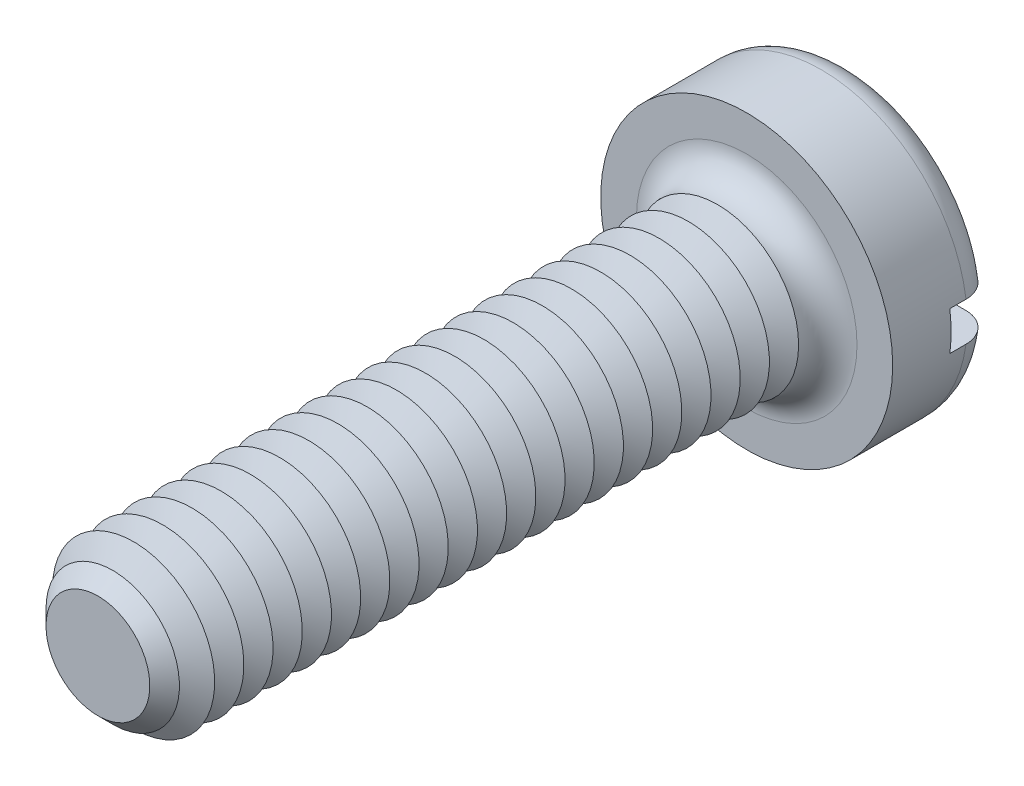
ISO-10303-21;
HEADER;
FILE_DESCRIPTION(('STEP AP214'),'2;1');
FILE_NAME('part.step','',(''),(''),'','','');
FILE_SCHEMA(('AUTOMOTIVE_DESIGN { 1 0 10303 214 1 1 1 1 }'));
ENDSEC;
DATA;
#1=APPLICATION_CONTEXT('core data for automotive mechanical design processes');
#2=APPLICATION_PROTOCOL_DEFINITION('international standard','automotive_design',2000,#1);
#3=PRODUCT_CONTEXT('',#1,'mechanical');
#4=PRODUCT('Part','Part','',(#3));
#5=PRODUCT_RELATED_PRODUCT_CATEGORY('part','',(#4));
#6=PRODUCT_DEFINITION_FORMATION('','',#4);
#7=PRODUCT_DEFINITION_CONTEXT('part definition',#1,'design');
#8=PRODUCT_DEFINITION('design','',#6,#7);
#9=PRODUCT_DEFINITION_SHAPE('','',#8);
#10=(LENGTH_UNIT() NAMED_UNIT(*) SI_UNIT(.MILLI.,.METRE.));
#11=(NAMED_UNIT(*) PLANE_ANGLE_UNIT() SI_UNIT($,.RADIAN.));
#12=(NAMED_UNIT(*) SI_UNIT($,.STERADIAN.) SOLID_ANGLE_UNIT());
#13=UNCERTAINTY_MEASURE_WITH_UNIT(LENGTH_MEASURE(1.E-05),#10,'distance_accuracy_value','');
#14=(GEOMETRIC_REPRESENTATION_CONTEXT(3) GLOBAL_UNCERTAINTY_ASSIGNED_CONTEXT((#13)) GLOBAL_UNIT_ASSIGNED_CONTEXT((#10,
#11,#12)) REPRESENTATION_CONTEXT('',''));
#15=CARTESIAN_POINT('',(0.,0.,0.));
#16=DIRECTION('',(0.,0.,1.));
#17=DIRECTION('',(1.,0.,0.));
#18=AXIS2_PLACEMENT_3D('',#15,#16,#17);
#19=CARTESIAN_POINT('',(0.,0.,-1.6));
#20=DIRECTION('',(0.,0.,1.));
#21=DIRECTION('',(1.,0.,0.));
#22=AXIS2_PLACEMENT_3D('',#19,#20,#21);
#23=PLANE('',#22);
#24=CARTESIAN_POINT('',(0.,0.,-1.6));
#25=DIRECTION('',(0.,0.,1.));
#26=DIRECTION('',(1.,0.,0.));
#27=AXIS2_PLACEMENT_3D('',#24,#25,#26);
#28=CIRCLE('',#27,1.8);
#29=CARTESIAN_POINT('',(-1.77482393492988,0.3,-1.6));
#30=VERTEX_POINT('',#29);
#31=CARTESIAN_POINT('',(1.77482393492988,0.3,-1.6));
#32=VERTEX_POINT('',#31);
#33=EDGE_CURVE('E116',#30,#32,#28,.F.);
#34=ORIENTED_EDGE('',*,*,#33,.T.);
#35=DIRECTION('',(1.,0.,0.));
#36=VECTOR('',#35,1.);
#37=CARTESIAN_POINT('',(-2.25,0.3,-1.6));
#38=LINE('',#37,#36);
#39=EDGE_CURVE('E111',#30,#32,#38,.T.);
#40=ORIENTED_EDGE('',*,*,#39,.F.);
#41=EDGE_LOOP('',(#34,#40));
#42=FACE_BOUND('',#41,.T.);
#43=ADVANCED_FACE('F39',(#42),#23,.F.);
#44=CARTESIAN_POINT('',(0.,0.,-1.15));
#45=DIRECTION('',(0.,0.,1.));
#46=DIRECTION('',(1.,0.,0.));
#47=AXIS2_PLACEMENT_3D('',#44,#45,#46);
#48=TOROIDAL_SURFACE('',#47,1.8,0.45);
#49=CARTESIAN_POINT('',(-2.09367249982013,0.3,-1.4713087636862));
#50=CARTESIAN_POINT('',(-2.07531034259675,0.3,-1.48912990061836));
#51=CARTESIAN_POINT('',(-2.05541605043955,0.3,-1.50540110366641));
#52=CARTESIAN_POINT('',(-2.01315405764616,0.3,-1.53437465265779));
#53=CARTESIAN_POINT('',(-1.99078310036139,0.3,-1.54707221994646));
#54=CARTESIAN_POINT('',(-1.94425163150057,0.3,-1.56853090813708));
#55=CARTESIAN_POINT('',(-1.92009286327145,0.3,-1.57729580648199));
#56=CARTESIAN_POINT('',(-1.8706617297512,0.3,-1.59068015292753));
#57=CARTESIAN_POINT('',(-1.84538964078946,0.3,-1.59530062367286));
#58=CARTESIAN_POINT('',(-1.7942134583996,0.3,-1.60031507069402));
#59=CARTESIAN_POINT('',(-1.76830582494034,0.3,-1.60067291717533));
#60=CARTESIAN_POINT('',(-1.71679040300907,0.3,-1.59707477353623));
#61=CARTESIAN_POINT('',(-1.69118264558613,0.3,-1.59311834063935));
#62=CARTESIAN_POINT('',(-1.64075792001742,0.3,-1.58095464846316));
#63=CARTESIAN_POINT('',(-1.61594989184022,0.3,-1.57271029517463));
#64=CARTESIAN_POINT('',(-1.56806655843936,0.3,-1.55217762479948));
#65=CARTESIAN_POINT('',(-1.54499130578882,0.3,-1.53988918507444));
#66=CARTESIAN_POINT('',(-1.50122413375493,0.3,-1.51158963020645));
#67=CARTESIAN_POINT('',(-1.48053389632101,0.3,-1.49557591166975));
#68=CARTESIAN_POINT('',(-1.44217532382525,0.3,-1.46026359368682));
#69=CARTESIAN_POINT('',(-1.42450683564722,0.3,-1.4409651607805));
#70=CARTESIAN_POINT('',(-1.39293961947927,0.3,-1.39986821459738));
#71=CARTESIAN_POINT('',(-1.37899788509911,0.3,-1.37810275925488));
#72=CARTESIAN_POINT('',(-1.35506190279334,0.3,-1.33249939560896));
#73=CARTESIAN_POINT('',(-1.34506709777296,0.3,-1.30866178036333));
#74=CARTESIAN_POINT('',(-1.3295415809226,0.3,-1.26015137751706));
#75=CARTESIAN_POINT('',(-1.32391771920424,0.3,-1.23550839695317));
#76=CARTESIAN_POINT('',(-1.31696995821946,0.3,-1.18562442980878));
#77=CARTESIAN_POINT('',(-1.31564552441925,0.3,-1.16038351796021));
#78=CARTESIAN_POINT('',(-1.31732714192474,0.3,-1.11049178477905));
#79=CARTESIAN_POINT('',(-1.32025766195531,0.3,-1.08583837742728));
#80=CARTESIAN_POINT('',(-1.3302124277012,0.3,-1.03737369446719));
#81=CARTESIAN_POINT('',(-1.33723664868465,0.3,-1.01356241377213));
#82=CARTESIAN_POINT('',(-1.35515820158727,0.3,-0.967413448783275));
#83=CARTESIAN_POINT('',(-1.36606032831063,0.3,-0.945077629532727));
#84=CARTESIAN_POINT('',(-1.39139351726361,0.3,-0.902507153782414));
#85=CARTESIAN_POINT('',(-1.40582489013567,0.3,-0.882272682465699));
#86=CARTESIAN_POINT('',(-1.43808691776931,0.3,-0.844072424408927));
#87=CARTESIAN_POINT('',(-1.4559757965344,0.3,-0.826155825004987));
#88=CARTESIAN_POINT('',(-1.49445205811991,0.3,-0.793502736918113));
#89=CARTESIAN_POINT('',(-1.51503974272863,0.3,-0.778766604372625));
#90=CARTESIAN_POINT('',(-1.55880475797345,0.3,-0.752571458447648));
#91=CARTESIAN_POINT('',(-1.58202794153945,0.3,-0.741189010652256));
#92=CARTESIAN_POINT('',(-1.63004083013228,0.3,-0.722432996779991));
#93=CARTESIAN_POINT('',(-1.65483064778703,0.3,-0.715059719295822));
#94=CARTESIAN_POINT('',(-1.70558060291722,0.3,-0.704463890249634));
#95=CARTESIAN_POINT('',(-1.73155090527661,0.3,-0.701289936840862));
#96=CARTESIAN_POINT('',(-1.78365633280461,0.3,-0.699350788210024));
#97=CARTESIAN_POINT('',(-1.80979145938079,0.3,-0.700585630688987));
#98=CARTESIAN_POINT('',(-1.86145503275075,0.3,-0.70744393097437));
#99=CARTESIAN_POINT('',(-1.88698403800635,0.3,-0.713063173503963));
#100=CARTESIAN_POINT('',(-1.93672112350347,0.3,-0.728546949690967));
#101=CARTESIAN_POINT('',(-1.96092925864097,0.3,-0.738411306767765));
#102=CARTESIAN_POINT('',(-2.00710191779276,0.3,-0.762015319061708));
#103=CARTESIAN_POINT('',(-2.02908465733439,0.3,-0.775719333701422));
#104=CARTESIAN_POINT('',(-2.0704025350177,0.3,-0.806663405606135));
#105=CARTESIAN_POINT('',(-2.08973782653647,0.3,-0.823903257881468));
#106=CARTESIAN_POINT('',(-2.12497879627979,0.3,-0.861218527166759));
#107=CARTESIAN_POINT('',(-2.1409209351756,0.3,-0.881259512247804));
#108=CARTESIAN_POINT('',(-2.16917502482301,0.3,-0.92375535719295));
#109=CARTESIAN_POINT('',(-2.18148717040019,0.3,-0.946210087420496));
#110=CARTESIAN_POINT('',(-2.20201023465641,0.3,-0.99266079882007));
#111=CARTESIAN_POINT('',(-2.21025973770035,0.3,-1.01663973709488));
#112=CARTESIAN_POINT('',(-2.22258852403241,0.3,-1.06564563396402));
#113=CARTESIAN_POINT('',(-2.22666813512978,0.3,-1.0906725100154));
#114=CARTESIAN_POINT('',(-2.23052418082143,0.3,-1.14090288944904));
#115=CARTESIAN_POINT('',(-2.23032644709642,0.3,-1.16610441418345));
#116=CARTESIAN_POINT('',(-2.22569614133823,0.3,-1.21612212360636));
#117=CARTESIAN_POINT('',(-2.2212625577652,0.3,-1.24093821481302));
#118=CARTESIAN_POINT('',(-2.20829785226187,0.3,-1.2894516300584));
#119=CARTESIAN_POINT('',(-2.19976997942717,0.3,-1.31314982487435));
#120=CARTESIAN_POINT('',(-2.17887390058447,0.3,-1.35876313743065));
#121=CARTESIAN_POINT('',(-2.1665103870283,0.3,-1.3806803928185));
#122=CARTESIAN_POINT('',(-2.14384463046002,0.3,-1.4140108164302));
#123=CARTESIAN_POINT('',(-2.13462949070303,0.3,-1.42617780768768));
#124=CARTESIAN_POINT('',(-2.1150151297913,0.3,-1.44951629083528));
#125=CARTESIAN_POINT('',(-2.10461591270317,0.3,-1.46068778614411));
#126=CARTESIAN_POINT('',(-2.09367249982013,0.3,-1.4713087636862));
#127=B_SPLINE_CURVE_WITH_KNOTS('',3,(#49,#50,#51,#52,#53,#54,#55,#56,#57,#58,#59,#60,#61,#62,
#63,#64,#65,#66,#67,#68,#69,#70,#71,#72,#73,#74,#75,#76,#77,#78,#79,#80,#81,#82,#83,#84,#85,#86,
#87,#88,#89,#90,#91,#92,#93,#94,#95,#96,#97,#98,#99,#100,#101,#102,#103,#104,#105,#106,#107,
#108,#109,#110,#111,#112,#113,#114,#115,#116,#117,#118,#119,#120,#121,#122,#123,#124,#125,#126),
.UNSPECIFIED.,.T.,.F.,(4,2,2,2,2,2,2,2,2,2,2,2,2,2,2,2,2,2,2,2,2,2,2,2,2,2,2,2,2,2,2,2,2,2,2,2,
2,2,4),(0.,0.0767085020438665,0.153519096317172,0.230255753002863,0.306973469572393,
0.384340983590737,0.461716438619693,0.539772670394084,0.617831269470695,0.695944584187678,
0.774053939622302,0.851218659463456,0.928372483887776,1.00383319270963,1.07928451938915,
1.15341274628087,1.22754052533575,1.30176027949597,1.37598656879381,1.45159320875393,
1.52720831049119,1.6044355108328,1.68166826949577,1.75978723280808,1.8379068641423,
1.91595148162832,1.99399285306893,2.07133254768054,2.14866775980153,2.22512456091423,
2.30157725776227,2.3772891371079,2.45299506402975,2.52824391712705,2.60351074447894,
2.67871794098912,2.75383349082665,2.79955010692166,2.84526656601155),.UNSPECIFIED.);
#128=CARTESIAN_POINT('',(-2.22991031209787,0.3,-1.14999999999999));
#129=VERTEX_POINT('',#128);
#130=EDGE_CURVE('E353',#129,#30,#127,.T.);
#131=ORIENTED_EDGE('',*,*,#130,.F.);
#132=CARTESIAN_POINT('',(0.,0.,-1.15));
#133=DIRECTION('',(0.,0.,1.));
#134=DIRECTION('',(1.,0.,0.));
#135=AXIS2_PLACEMENT_3D('',#132,#133,#134);
#136=CIRCLE('',#135,2.25);
#137=CARTESIAN_POINT('',(2.22991031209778,0.3,-1.15));
#138=VERTEX_POINT('',#137);
#139=EDGE_CURVE('E125',#138,#129,#136,.T.);
#140=ORIENTED_EDGE('',*,*,#139,.F.);
#141=CARTESIAN_POINT('',(1.39325818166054,0.3,-1.39903402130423));
#142=CARTESIAN_POINT('',(1.40771723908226,0.3,-1.42030595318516));
#143=CARTESIAN_POINT('',(1.4240122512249,0.3,-1.4403555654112));
#144=CARTESIAN_POINT('',(1.45976320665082,0.3,-1.4774406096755));
#145=CARTESIAN_POINT('',(1.47922380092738,0.3,-1.49447152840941));
#146=CARTESIAN_POINT('',(1.5206923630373,0.3,-1.52502510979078));
#147=CARTESIAN_POINT('',(1.54269721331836,0.3,-1.53855200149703));
#148=CARTESIAN_POINT('',(1.58863815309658,0.3,-1.56176272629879));
#149=CARTESIAN_POINT('',(1.61257369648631,0.3,-1.57144764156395));
#150=CARTESIAN_POINT('',(1.66199169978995,0.3,-1.58680804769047));
#151=CARTESIAN_POINT('',(1.68748839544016,0.3,-1.59243778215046));
#152=CARTESIAN_POINT('',(1.73906656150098,0.3,-1.59934902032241));
#153=CARTESIAN_POINT('',(1.76514807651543,0.3,-1.60063019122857));
#154=CARTESIAN_POINT('',(1.81721740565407,0.3,-1.59879130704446));
#155=CARTESIAN_POINT('',(1.84320486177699,0.3,-1.59566102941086));
#156=CARTESIAN_POINT('',(1.89427635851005,0.3,-1.58504931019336));
#157=CARTESIAN_POINT('',(1.91936042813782,0.3,-1.57756800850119));
#158=CARTESIAN_POINT('',(1.9677137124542,0.3,-1.55851722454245));
#159=CARTESIAN_POINT('',(1.99099484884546,0.3,-1.5469780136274));
#160=CARTESIAN_POINT('',(2.03525897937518,0.3,-1.52011224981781));
#161=CARTESIAN_POINT('',(2.05624211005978,0.3,-1.50478592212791));
#162=CARTESIAN_POINT('',(2.09506403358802,0.3,-1.47096472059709));
#163=CARTESIAN_POINT('',(2.11293536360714,0.3,-1.45250719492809));
#164=CARTESIAN_POINT('',(2.14528563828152,0.3,-1.41282609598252));
#165=CARTESIAN_POINT('',(2.15976477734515,0.3,-1.39160268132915));
#166=CARTESIAN_POINT('',(2.18476262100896,0.3,-1.34723254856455));
#167=CARTESIAN_POINT('',(2.19532119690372,0.3,-1.32410828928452));
#168=CARTESIAN_POINT('',(2.21237438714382,0.3,-1.27640693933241));
#169=CARTESIAN_POINT('',(2.21886918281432,0.3,-1.25182991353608));
#170=CARTESIAN_POINT('',(2.2275687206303,0.3,-1.20210937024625));
#171=CARTESIAN_POINT('',(2.22980376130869,0.3,-1.17697115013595));
#172=CARTESIAN_POINT('',(2.23000940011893,0.3,-1.12667754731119));
#173=CARTESIAN_POINT('',(2.22798009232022,0.3,-1.10152216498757));
#174=CARTESIAN_POINT('',(2.21972856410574,0.3,-1.05197773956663));
#175=CARTESIAN_POINT('',(2.21351744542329,0.3,-1.02758684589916));
#176=CARTESIAN_POINT('',(2.19709696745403,0.3,-0.980190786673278));
#177=CARTESIAN_POINT('',(2.18688760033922,0.3,-0.957185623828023));
#178=CARTESIAN_POINT('',(2.1627435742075,0.3,-0.913157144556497));
#179=CARTESIAN_POINT('',(2.14880093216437,0.3,-0.892138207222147));
#180=CARTESIAN_POINT('',(2.11760640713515,0.3,-0.852719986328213));
#181=CARTESIAN_POINT('',(2.10035443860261,0.3,-0.834320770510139));
#182=CARTESIAN_POINT('',(2.06291254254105,0.3,-0.80052923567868));
#183=CARTESIAN_POINT('',(2.04270386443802,0.3,-0.785157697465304));
#184=CARTESIAN_POINT('',(2.0000139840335,0.3,-0.757986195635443));
#185=CARTESIAN_POINT('',(1.97753267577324,0.3,-0.746186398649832));
#186=CARTESIAN_POINT('',(1.93069507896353,0.3,-0.726364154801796));
#187=CARTESIAN_POINT('',(1.90632219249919,0.3,-0.718380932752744));
#188=CARTESIAN_POINT('',(1.85658993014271,0.3,-0.706569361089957));
#189=CARTESIAN_POINT('',(1.83123049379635,0.3,-0.702741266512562));
#190=CARTESIAN_POINT('',(1.77994107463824,0.3,-0.699306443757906));
#191=CARTESIAN_POINT('',(1.75400788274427,0.3,-0.69974759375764));
#192=CARTESIAN_POINT('',(1.70257608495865,0.3,-0.704939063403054));
#193=CARTESIAN_POINT('',(1.67707750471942,0.3,-0.709689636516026));
#194=CARTESIAN_POINT('',(1.62701662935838,0.3,-0.723419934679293));
#195=CARTESIAN_POINT('',(1.60246387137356,0.3,-0.732434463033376));
#196=CARTESIAN_POINT('',(1.55521886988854,0.3,-0.754458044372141));
#197=CARTESIAN_POINT('',(1.53252668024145,0.3,-0.76746721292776));
#198=CARTESIAN_POINT('',(1.48966925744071,0.3,-0.797124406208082));
#199=CARTESIAN_POINT('',(1.46950315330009,0.3,-0.813771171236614));
#200=CARTESIAN_POINT('',(1.43229728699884,0.3,-0.850255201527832));
#201=CARTESIAN_POINT('',(1.41525734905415,0.3,-0.870092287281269));
#202=CARTESIAN_POINT('',(1.3850470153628,0.3,-0.912123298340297));
#203=CARTESIAN_POINT('',(1.37182821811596,0.3,-0.934282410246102));
#204=CARTESIAN_POINT('',(1.34939737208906,0.3,-0.980542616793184));
#205=CARTESIAN_POINT('',(1.34018456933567,0.3,-1.00464334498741));
#206=CARTESIAN_POINT('',(1.32624172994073,0.3,-1.05352472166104));
#207=CARTESIAN_POINT('',(1.32141599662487,0.3,-1.07827808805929));
#208=CARTESIAN_POINT('',(1.31606478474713,0.3,-1.12825155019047));
#209=CARTESIAN_POINT('',(1.31553992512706,0.3,-1.15347171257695));
#210=CARTESIAN_POINT('',(1.31878307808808,0.3,-1.20323022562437));
#211=CARTESIAN_POINT('',(1.32248353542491,0.3,-1.22777305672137));
#212=CARTESIAN_POINT('',(1.33394086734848,0.3,-1.27586981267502));
#213=CARTESIAN_POINT('',(1.34169274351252,0.3,-1.2994249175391));
#214=CARTESIAN_POINT('',(1.35704250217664,0.3,-1.33561898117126));
#215=CARTESIAN_POINT('',(1.36341395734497,0.3,-1.34879219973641));
#216=CARTESIAN_POINT('',(1.37741190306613,0.3,-1.37445328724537));
#217=CARTESIAN_POINT('',(1.38503837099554,0.3,-1.38694116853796));
#218=CARTESIAN_POINT('',(1.39325818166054,0.3,-1.39903402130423));
#219=B_SPLINE_CURVE_WITH_KNOTS('',3,(#141,#142,#143,#144,#145,#146,#147,#148,#149,#150,#151,
#152,#153,#154,#155,#156,#157,#158,#159,#160,#161,#162,#163,#164,#165,#166,#167,#168,#169,#170,
#171,#172,#173,#174,#175,#176,#177,#178,#179,#180,#181,#182,#183,#184,#185,#186,#187,#188,#189,
#190,#191,#192,#193,#194,#195,#196,#197,#198,#199,#200,#201,#202,#203,#204,#205,#206,#207,#208,
#209,#210,#211,#212,#213,#214,#215,#216,#217,#218),.UNSPECIFIED.,.T.,.F.,(4,2,2,2,2,2,2,2,2,2,2,
2,2,2,2,2,2,2,2,2,2,2,2,2,2,2,2,2,2,2,2,2,2,2,2,2,2,2,4),(0.,0.0771077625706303,
0.154329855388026,0.231458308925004,0.308565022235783,0.386528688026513,0.464498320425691,
0.542648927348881,0.620797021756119,0.698374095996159,0.77594655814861,0.852651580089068,
0.929352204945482,1.00524992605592,1.08114426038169,1.15649673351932,1.2318475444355,
1.30699910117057,1.38215080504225,1.45746451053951,1.53278016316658,1.60859599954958,
1.68441537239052,1.76099806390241,1.83758545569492,1.91503273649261,1.99248457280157,
2.07057979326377,2.14867727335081,2.22674775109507,2.30481383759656,2.38184276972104,
2.45885719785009,2.53414829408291,2.6094502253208,2.68356487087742,2.75758829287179,
2.80142397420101,2.84525886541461),.UNSPECIFIED.);
#220=EDGE_CURVE('E355',#32,#138,#219,.T.);
#221=ORIENTED_EDGE('',*,*,#220,.F.);
#222=ORIENTED_EDGE('',*,*,#33,.F.);
#223=EDGE_LOOP('',(#131,#140,#221,#222));
#224=FACE_BOUND('',#223,.T.);
#225=ADVANCED_FACE('F337',(#224),#48,.T.);
#226=CARTESIAN_POINT('',(0.,0.,-1.6));
#227=DIRECTION('',(0.,0.,1.));
#228=DIRECTION('',(1.,0.,0.));
#229=AXIS2_PLACEMENT_3D('',#226,#227,#228);
#230=CYLINDRICAL_SURFACE('',#229,2.25);
#231=DIRECTION('',(0.,0.,1.));
#232=VECTOR('',#231,1.);
#233=CARTESIAN_POINT('',(2.22991031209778,0.3,-1.6));
#234=LINE('',#233,#232);
#235=CARTESIAN_POINT('',(2.22991031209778,0.3,-0.9));
#236=VERTEX_POINT('',#235);
#237=EDGE_CURVE('E369',#138,#236,#234,.T.);
#238=ORIENTED_EDGE('',*,*,#237,.F.);
#239=ORIENTED_EDGE('',*,*,#139,.T.);
#240=DIRECTION('',(0.,0.,1.));
#241=VECTOR('',#240,1.);
#242=CARTESIAN_POINT('',(-2.22991031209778,0.3,-1.6));
#243=LINE('',#242,#241);
#244=CARTESIAN_POINT('',(-2.22991031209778,0.3,-0.9));
#245=VERTEX_POINT('',#244);
#246=EDGE_CURVE('E63',#245,#129,#243,.F.);
#247=ORIENTED_EDGE('',*,*,#246,.F.);
#248=CARTESIAN_POINT('',(0.,0.,-0.9));
#249=DIRECTION('',(0.,0.,-1.));
#250=DIRECTION('',(-1.,0.,0.));
#251=AXIS2_PLACEMENT_3D('',#248,#249,#250);
#252=CIRCLE('',#251,2.25);
#253=CARTESIAN_POINT('',(-2.22991031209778,-0.3,-0.9));
#254=VERTEX_POINT('',#253);
#255=EDGE_CURVE('E43',#245,#254,#252,.F.);
#256=ORIENTED_EDGE('',*,*,#255,.T.);
#257=DIRECTION('',(0.,0.,1.));
#258=VECTOR('',#257,1.);
#259=CARTESIAN_POINT('',(-2.22991031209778,-0.3,-1.6));
#260=LINE('',#259,#258);
#261=CARTESIAN_POINT('',(-2.22991031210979,-0.3,-1.15000000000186));
#262=VERTEX_POINT('',#261);
#263=EDGE_CURVE('E367',#262,#254,#260,.T.);
#264=ORIENTED_EDGE('',*,*,#263,.F.);
#265=CARTESIAN_POINT('',(2.22991031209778,-0.3,-1.15));
#266=VERTEX_POINT('',#265);
#267=EDGE_CURVE('E127',#262,#266,#136,.T.);
#268=ORIENTED_EDGE('',*,*,#267,.T.);
#269=DIRECTION('',(0.,0.,1.));
#270=VECTOR('',#269,1.);
#271=CARTESIAN_POINT('',(2.22991031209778,-0.3,-1.6));
#272=LINE('',#271,#270);
#273=CARTESIAN_POINT('',(2.22991031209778,-0.3,-0.9));
#274=VERTEX_POINT('',#273);
#275=EDGE_CURVE('E55',#274,#266,#272,.F.);
#276=ORIENTED_EDGE('',*,*,#275,.F.);
#277=EDGE_CURVE('E11',#274,#236,#252,.F.);
#278=ORIENTED_EDGE('',*,*,#277,.T.);
#279=EDGE_LOOP('',(#238,#239,#247,#256,#264,#268,#276,#278));
#280=FACE_BOUND('',#279,.T.);
#281=CARTESIAN_POINT('',(0.,0.,0.));
#282=DIRECTION('',(0.,0.,1.));
#283=DIRECTION('',(1.,0.,0.));
#284=AXIS2_PLACEMENT_3D('',#281,#282,#283);
#285=CIRCLE('',#284,2.25);
#286=CARTESIAN_POINT('',(2.25,0.,0.));
#287=VERTEX_POINT('',#286);
#288=EDGE_CURVE('E372',#287,#287,#285,.T.);
#289=ORIENTED_EDGE('',*,*,#288,.F.);
#290=EDGE_LOOP('',(#289));
#291=FACE_BOUND('',#290,.T.);
#292=ADVANCED_FACE('F333',(#280,#291),#230,.T.);
#293=CARTESIAN_POINT('',(1.77482393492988,-0.3,-1.6));
#294=VERTEX_POINT('',#293);
#295=CARTESIAN_POINT('',(-1.77482393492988,-0.3,-1.6));
#296=VERTEX_POINT('',#295);
#297=EDGE_CURVE('E109',#294,#296,#28,.F.);
#298=ORIENTED_EDGE('',*,*,#297,.T.);
#299=DIRECTION('',(-1.,0.,0.));
#300=VECTOR('',#299,1.);
#301=CARTESIAN_POINT('',(-2.25,-0.3,-1.6));
#302=LINE('',#301,#300);
#303=EDGE_CURVE('E96',#294,#296,#302,.T.);
#304=ORIENTED_EDGE('',*,*,#303,.F.);
#305=EDGE_LOOP('',(#298,#304));
#306=FACE_BOUND('',#305,.T.);
#307=ADVANCED_FACE('F108',(#306),#23,.F.);
#308=CARTESIAN_POINT('',(0.,0.,0.));
#309=DIRECTION('',(0.,0.,1.));
#310=DIRECTION('',(1.,0.,0.));
#311=AXIS2_PLACEMENT_3D('',#308,#309,#310);
#312=PLANE('',#311);
#313=CARTESIAN_POINT('',(0.,0.,0.));
#314=DIRECTION('',(0.,0.,1.));
#315=DIRECTION('',(1.,0.,0.));
#316=AXIS2_PLACEMENT_3D('',#313,#314,#315);
#317=CIRCLE('',#316,1.7);
#318=CARTESIAN_POINT('',(1.7,0.,0.));
#319=VERTEX_POINT('',#318);
#320=EDGE_CURVE('E115',#319,#319,#317,.F.);
#321=ORIENTED_EDGE('',*,*,#320,.T.);
#322=EDGE_LOOP('',(#321));
#323=FACE_BOUND('',#322,.T.);
#324=ORIENTED_EDGE('',*,*,#288,.T.);
#325=EDGE_LOOP('',(#324));
#326=FACE_BOUND('',#325,.T.);
#327=ADVANCED_FACE('F332',(#323,#326),#312,.T.);
#328=CARTESIAN_POINT('',(-2.09367249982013,-0.3,-1.4713087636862));
#329=CARTESIAN_POINT('',(-2.11176539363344,-0.3,-1.45374579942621));
#330=CARTESIAN_POINT('',(-2.1283968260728,-0.3,-1.43465254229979));
#331=CARTESIAN_POINT('',(-2.15823692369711,-0.3,-1.39393307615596));
#332=CARTESIAN_POINT('',(-2.17144184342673,-0.3,-1.37230413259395));
#333=CARTESIAN_POINT('',(-2.19402281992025,-0.3,-1.32713362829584));
#334=CARTESIAN_POINT('',(-2.20339951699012,-0.3,-1.30359238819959));
#335=CARTESIAN_POINT('',(-2.21804409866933,-0.3,-1.25527081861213));
#336=CARTESIAN_POINT('',(-2.22331295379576,-0.3,-1.23049078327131));
#337=CARTESIAN_POINT('',(-2.22957448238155,-0.3,-1.18050893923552));
#338=CARTESIAN_POINT('',(-2.23058617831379,-0.3,-1.15530951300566));
#339=CARTESIAN_POINT('',(-2.22835535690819,-0.3,-1.10509920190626));
#340=CARTESIAN_POINT('',(-2.22511277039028,-0.3,-1.08008832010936));
#341=CARTESIAN_POINT('',(-2.21448018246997,-0.3,-1.03101646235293));
#342=CARTESIAN_POINT('',(-2.20709836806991,-0.3,-1.00695371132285));
#343=CARTESIAN_POINT('',(-2.18841075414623,-0.3,-0.960404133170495));
#344=CARTESIAN_POINT('',(-2.17710493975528,-0.3,-0.937917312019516));
#345=CARTESIAN_POINT('',(-2.15086234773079,-0.3,-0.895085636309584));
#346=CARTESIAN_POINT('',(-2.13591537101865,-0.3,-0.874747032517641));
#347=CARTESIAN_POINT('',(-2.1028415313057,-0.3,-0.836845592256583));
#348=CARTESIAN_POINT('',(-2.08471458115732,-0.3,-0.819282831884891));
#349=CARTESIAN_POINT('',(-2.0456590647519,-0.3,-0.78729174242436));
#350=CARTESIAN_POINT('',(-2.0247112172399,-0.3,-0.772886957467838));
#351=CARTESIAN_POINT('',(-1.98071452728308,-0.3,-0.747756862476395));
#352=CARTESIAN_POINT('',(-1.95766557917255,-0.3,-0.737031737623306));
#353=CARTESIAN_POINT('',(-1.90986554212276,-0.3,-0.71944451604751));
#354=CARTESIAN_POINT('',(-1.88509923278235,-0.3,-0.712623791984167));
#355=CARTESIAN_POINT('',(-1.83477837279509,-0.3,-0.703186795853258));
#356=CARTESIAN_POINT('',(-1.80922377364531,-0.3,-0.700570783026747));
#357=CARTESIAN_POINT('',(-1.75774893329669,-0.3,-0.699591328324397));
#358=CARTESIAN_POINT('',(-1.73182778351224,-0.3,-0.701275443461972));
#359=CARTESIAN_POINT('',(-1.68062744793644,-0.3,-0.708937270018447));
#360=CARTESIAN_POINT('',(-1.65534829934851,-0.3,-0.714915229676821));
#361=CARTESIAN_POINT('',(-1.6059539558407,-0.3,-0.731056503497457));
#362=CARTESIAN_POINT('',(-1.58184881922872,-0.3,-0.741250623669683));
#363=CARTESIAN_POINT('',(-1.53569497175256,-0.3,-0.765548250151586));
#364=CARTESIAN_POINT('',(-1.51364629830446,-0.3,-0.779651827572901));
#365=CARTESIAN_POINT('',(-1.47229470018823,-0.3,-0.811355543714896));
#366=CARTESIAN_POINT('',(-1.45298625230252,-0.3,-0.828948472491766));
#367=CARTESIAN_POINT('',(-1.41765142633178,-0.3,-0.867170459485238));
#368=CARTESIAN_POINT('',(-1.40162480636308,-0.3,-0.887799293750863));
#369=CARTESIAN_POINT('',(-1.37358365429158,-0.3,-0.93118317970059));
#370=CARTESIAN_POINT('',(-1.3615121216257,-0.3,-0.953901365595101));
#371=CARTESIAN_POINT('',(-1.34145576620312,-0.3,-1.00107529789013));
#372=CARTESIAN_POINT('',(-1.33347032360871,-0.3,-1.02553078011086));
#373=CARTESIAN_POINT('',(-1.32199536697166,-0.3,-1.07489401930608));
#374=CARTESIAN_POINT('',(-1.31840873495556,-0.3,-1.09977921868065));
#375=CARTESIAN_POINT('',(-1.31553052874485,-0.3,-1.1497957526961));
#376=CARTESIAN_POINT('',(-1.31623852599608,-0.3,-1.17492706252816));
#377=CARTESIAN_POINT('',(-1.32188368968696,-0.3,-1.22435119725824));
#378=CARTESIAN_POINT('',(-1.32676151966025,-0.3,-1.24865083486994));
#379=CARTESIAN_POINT('',(-1.34050334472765,-0.3,-1.29609421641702));
#380=CARTESIAN_POINT('',(-1.34936742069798,-0.3,-1.31923793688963));
#381=CARTESIAN_POINT('',(-1.37086295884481,-0.3,-1.36387796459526));
#382=CARTESIAN_POINT('',(-1.38351729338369,-0.3,-1.38536324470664));
#383=CARTESIAN_POINT('',(-1.41218367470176,-0.3,-1.42596199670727));
#384=CARTESIAN_POINT('',(-1.42819606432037,-0.3,-1.44507522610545));
#385=CARTESIAN_POINT('',(-1.46347664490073,-0.3,-1.48081087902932));
#386=CARTESIAN_POINT('',(-1.48280543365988,-0.3,-1.49737347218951));
#387=CARTESIAN_POINT('',(-1.5239232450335,-0.3,-1.52709508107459));
#388=CARTESIAN_POINT('',(-1.54571253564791,-0.3,-1.54025372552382));
#389=CARTESIAN_POINT('',(-1.59160097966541,-0.3,-1.56305446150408));
#390=CARTESIAN_POINT('',(-1.61573734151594,-0.3,-1.57262172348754));
#391=CARTESIAN_POINT('',(-1.66526504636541,-0.3,-1.58760700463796));
#392=CARTESIAN_POINT('',(-1.69065641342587,-0.3,-1.59302494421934));
#393=CARTESIAN_POINT('',(-1.74220154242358,-0.3,-1.59958446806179));
#394=CARTESIAN_POINT('',(-1.7683598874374,-0.3,-1.60069012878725));
#395=CARTESIAN_POINT('',(-1.82049681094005,-0.3,-1.59847888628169));
#396=CARTESIAN_POINT('',(-1.8464753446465,-0.3,-1.59516091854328));
#397=CARTESIAN_POINT('',(-1.89742078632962,-0.3,-1.58419269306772));
#398=CARTESIAN_POINT('',(-1.92239041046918,-0.3,-1.57655503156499));
#399=CARTESIAN_POINT('',(-1.97064988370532,-0.3,-1.55715679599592));
#400=CARTESIAN_POINT('',(-1.99394179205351,-0.3,-1.54540138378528));
#401=CARTESIAN_POINT('',(-2.03003215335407,-0.3,-1.52312594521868));
#402=CARTESIAN_POINT('',(-2.04354254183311,-0.3,-1.51373809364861));
#403=CARTESIAN_POINT('',(-2.06946640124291,-0.3,-1.49355310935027));
#404=CARTESIAN_POINT('',(-2.08187987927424,-0.3,-1.48275598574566));
#405=CARTESIAN_POINT('',(-2.09367249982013,-0.3,-1.4713087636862));
#406=B_SPLINE_CURVE_WITH_KNOTS('',3,(#328,#329,#330,#331,#332,#333,#334,#335,#336,#337,#338,
#339,#340,#341,#342,#343,#344,#345,#346,#347,#348,#349,#350,#351,#352,#353,#354,#355,#356,#357,
#358,#359,#360,#361,#362,#363,#364,#365,#366,#367,#368,#369,#370,#371,#372,#373,#374,#375,#376,
#377,#378,#379,#380,#381,#382,#383,#384,#385,#386,#387,#388,#389,#390,#391,#392,#393,#394,#395,
#396,#397,#398,#399,#400,#401,#402,#403,#404,#405),.UNSPECIFIED.,.T.,.F.,(4,2,2,2,2,2,2,2,2,2,2,
2,2,2,2,2,2,2,2,2,2,2,2,2,2,2,2,2,2,2,2,2,2,2,2,2,2,2,4),(0.,0.0755864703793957,
0.151255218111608,0.226911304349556,0.302549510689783,0.377849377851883,0.453150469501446,
0.528303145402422,0.603456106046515,0.67882204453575,0.754190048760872,0.83010216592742,
0.906018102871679,0.982724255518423,1.05943513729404,1.13699806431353,1.21456547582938,
1.29270994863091,1.37085584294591,1.44884191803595,1.52682224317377,1.60362346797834,
1.68041303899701,1.75547480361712,1.83052907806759,1.90453278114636,1.97853798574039,
2.05299909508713,2.12746781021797,2.20347986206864,2.27950020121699,2.3570265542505,
2.43455439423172,2.5127267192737,2.59091785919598,2.66888216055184,2.74674907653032,
2.79601528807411,2.84528118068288),.UNSPECIFIED.);
#407=EDGE_CURVE('E103',#296,#262,#406,.T.);
#408=ORIENTED_EDGE('',*,*,#407,.F.);
#409=ORIENTED_EDGE('',*,*,#297,.F.);
#410=CARTESIAN_POINT('',(1.39325818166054,-0.3,-1.39903402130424));
#411=CARTESIAN_POINT('',(1.37924349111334,-0.3,-1.37841200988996));
#412=CARTESIAN_POINT('',(1.36693374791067,-0.3,-1.35661225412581));
#413=CARTESIAN_POINT('',(1.34612289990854,-0.3,-1.31124547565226));
#414=CARTESIAN_POINT('',(1.33762533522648,-0.3,-1.28767683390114));
#415=CARTESIAN_POINT('',(1.32472877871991,-0.3,-1.23943261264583));
#416=CARTESIAN_POINT('',(1.3203309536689,-0.3,-1.21475672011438));
#417=CARTESIAN_POINT('',(1.31579198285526,-0.3,-1.16502199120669));
#418=CARTESIAN_POINT('',(1.31564980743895,-0.3,-1.13996324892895));
#419=CARTESIAN_POINT('',(1.31960322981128,-0.3,-1.09044336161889));
#420=CARTESIAN_POINT('',(1.32365524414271,-0.3,-1.06597872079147));
#421=CARTESIAN_POINT('',(1.33579339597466,-0.3,-1.01807218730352));
#422=CARTESIAN_POINT('',(1.34387971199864,-0.3,-0.994630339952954));
#423=CARTESIAN_POINT('',(1.36386460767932,-0.3,-0.949319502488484));
#424=CARTESIAN_POINT('',(1.37577869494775,-0.3,-0.92745736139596));
#425=CARTESIAN_POINT('',(1.40303929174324,-0.3,-0.885990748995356));
#426=CARTESIAN_POINT('',(1.41838612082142,-0.3,-0.866386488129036));
#427=CARTESIAN_POINT('',(1.45239955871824,-0.3,-0.829572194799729));
#428=CARTESIAN_POINT('',(1.47112624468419,-0.3,-0.812417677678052));
#429=CARTESIAN_POINT('',(1.51114353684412,-0.3,-0.78141873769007));
#430=CARTESIAN_POINT('',(1.53243442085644,-0.3,-0.767574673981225));
#431=CARTESIAN_POINT('',(1.57744959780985,-0.3,-0.743302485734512));
#432=CARTESIAN_POINT('',(1.6012148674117,-0.3,-0.732950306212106));
#433=CARTESIAN_POINT('',(1.65013556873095,-0.3,-0.71633816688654));
#434=CARTESIAN_POINT('',(1.67529109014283,-0.3,-0.710078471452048));
#435=CARTESIAN_POINT('',(1.72654223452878,-0.3,-0.701786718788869));
#436=CARTESIAN_POINT('',(1.75264462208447,-0.3,-0.699796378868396));
#437=CARTESIAN_POINT('',(1.80481283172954,-0.3,-0.700236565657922));
#438=CARTESIAN_POINT('',(1.83087865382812,-0.3,-0.702667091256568));
#439=CARTESIAN_POINT('',(1.88216421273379,-0.3,-0.71188843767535));
#440=CARTESIAN_POINT('',(1.90738581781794,-0.3,-0.718668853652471));
#441=CARTESIAN_POINT('',(1.95631449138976,-0.3,-0.736408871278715));
#442=CARTESIAN_POINT('',(1.98002162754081,-0.3,-0.747368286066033));
#443=CARTESIAN_POINT('',(2.02500221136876,-0.3,-0.773046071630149));
#444=CARTESIAN_POINT('',(2.04629687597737,-0.3,-0.78772726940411));
#445=CARTESIAN_POINT('',(2.08608258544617,-0.3,-0.820494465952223));
#446=CARTESIAN_POINT('',(2.10457379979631,-0.3,-0.838580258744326));
#447=CARTESIAN_POINT('',(2.1380062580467,-0.3,-0.877422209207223));
#448=CARTESIAN_POINT('',(2.15298532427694,-0.3,-0.898145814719));
#449=CARTESIAN_POINT('',(2.17921311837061,-0.3,-0.941832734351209));
#450=CARTESIAN_POINT('',(2.19046204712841,-0.3,-0.964795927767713));
#451=CARTESIAN_POINT('',(2.20880507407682,-0.3,-1.01207981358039));
#452=CARTESIAN_POINT('',(2.2159367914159,-0.3,-1.0363859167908));
#453=CARTESIAN_POINT('',(2.22599386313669,-0.3,-1.08585317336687));
#454=CARTESIAN_POINT('',(2.22891936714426,-0.3,-1.11101429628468));
#455=CARTESIAN_POINT('',(2.23047255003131,-0.3,-1.16133395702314));
#456=CARTESIAN_POINT('',(2.22912306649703,-0.3,-1.18649179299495));
#457=CARTESIAN_POINT('',(2.22221641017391,-0.3,-1.236222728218));
#458=CARTESIAN_POINT('',(2.21665928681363,-0.3,-1.26079583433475));
#459=CARTESIAN_POINT('',(2.20150655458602,-0.3,-1.30864604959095));
#460=CARTESIAN_POINT('',(2.19191347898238,-0.3,-1.3319239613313));
#461=CARTESIAN_POINT('',(2.16897085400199,-0.3,-1.37654778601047));
#462=CARTESIAN_POINT('',(2.15562126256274,-0.3,-1.39789367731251));
#463=CARTESIAN_POINT('',(2.12549147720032,-0.3,-1.43814583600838));
#464=CARTESIAN_POINT('',(2.1086973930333,-0.3,-1.45704170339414));
#465=CARTESIAN_POINT('',(2.07219852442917,-0.3,-1.491773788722));
#466=CARTESIAN_POINT('',(2.0524936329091,-0.3,-1.50760989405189));
#467=CARTESIAN_POINT('',(2.01056127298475,-0.3,-1.53591667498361));
#468=CARTESIAN_POINT('',(1.98831430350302,-0.3,-1.54835845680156));
#469=CARTESIAN_POINT('',(1.94206418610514,-0.3,-1.5693763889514));
#470=CARTESIAN_POINT('',(1.91806093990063,-0.3,-1.57795232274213));
#471=CARTESIAN_POINT('',(1.86869953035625,-0.3,-1.5910955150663));
#472=CARTESIAN_POINT('',(1.84332941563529,-0.3,-1.59561788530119));
#473=CARTESIAN_POINT('',(1.7921914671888,-0.3,-1.60038767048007));
#474=CARTESIAN_POINT('',(1.76642362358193,-0.3,-1.60063497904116));
#475=CARTESIAN_POINT('',(1.71493241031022,-0.3,-1.59684388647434));
#476=CARTESIAN_POINT('',(1.6892123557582,-0.3,-1.59276040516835));
#477=CARTESIAN_POINT('',(1.63880694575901,-0.3,-1.58035661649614));
#478=CARTESIAN_POINT('',(1.61412189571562,-0.3,-1.5720350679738));
#479=CARTESIAN_POINT('',(1.56635013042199,-0.3,-1.55132424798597));
#480=CARTESIAN_POINT('',(1.54327365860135,-0.3,-1.53891136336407));
#481=CARTESIAN_POINT('',(1.49956705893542,-0.3,-1.51037484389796));
#482=CARTESIAN_POINT('',(1.478934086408,-0.3,-1.49425558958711));
#483=CARTESIAN_POINT('',(1.44732882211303,-0.3,-1.46489751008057));
#484=CARTESIAN_POINT('',(1.43548118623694,-0.3,-1.45258668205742));
#485=CARTESIAN_POINT('',(1.41324217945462,-0.3,-1.42671249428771));
#486=CARTESIAN_POINT('',(1.40285079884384,-0.3,-1.41314914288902));
#487=CARTESIAN_POINT('',(1.39325818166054,-0.3,-1.39903402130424));
#488=B_SPLINE_CURVE_WITH_KNOTS('',3,(#410,#411,#412,#413,#414,#415,#416,#417,#418,#419,#420,
#421,#422,#423,#424,#425,#426,#427,#428,#429,#430,#431,#432,#433,#434,#435,#436,#437,#438,#439,
#440,#441,#442,#443,#444,#445,#446,#447,#448,#449,#450,#451,#452,#453,#454,#455,#456,#457,#458,
#459,#460,#461,#462,#463,#464,#465,#466,#467,#468,#469,#470,#471,#472,#473,#474,#475,#476,#477,
#478,#479,#480,#481,#482,#483,#484,#485,#486,#487),.UNSPECIFIED.,.T.,.F.,(4,2,2,2,2,2,2,2,2,2,2,
2,2,2,2,2,2,2,2,2,2,2,2,2,2,2,2,2,2,2,2,2,2,2,2,2,2,2,4),(0.,0.0747398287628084,
0.149548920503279,0.224379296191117,0.29919156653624,0.373234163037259,0.447280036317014,
0.521629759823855,0.595986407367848,0.671825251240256,0.747672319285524,0.825076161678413,
0.902485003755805,0.980646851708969,1.05880868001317,1.13678424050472,1.21475631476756,
1.29197834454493,1.36919570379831,1.44553881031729,1.52187780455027,1.59750777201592,
1.67313504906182,1.74835899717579,1.82358206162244,1.89875798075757,1.97393474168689,
2.04942084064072,2.12490971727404,2.20102244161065,2.27713942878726,2.35408926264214,
2.43104101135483,2.50880170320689,2.58658518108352,2.66482568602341,2.74297419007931,
2.79413160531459,2.84528867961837),.UNSPECIFIED.);
#489=EDGE_CURVE('E92',#266,#294,#488,.T.);
#490=ORIENTED_EDGE('',*,*,#489,.F.);
#491=ORIENTED_EDGE('',*,*,#267,.F.);
#492=EDGE_LOOP('',(#408,#409,#490,#491));
#493=FACE_BOUND('',#492,.T.);
#494=ADVANCED_FACE('F113',(#493),#48,.T.);
#495=CARTESIAN_POINT('',(0.,0.,0.450000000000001));
#496=DIRECTION('',(0.,0.,1.));
#497=DIRECTION('',(1.,0.,0.));
#498=AXIS2_PLACEMENT_3D('',#495,#496,#497);
#499=TOROIDAL_SURFACE('',#498,1.7,0.45);
#500=ORIENTED_EDGE('',*,*,#320,.F.);
#501=EDGE_LOOP('',(#500));
#502=FACE_BOUND('',#501,.T.);
#503=CARTESIAN_POINT('',(0.,0.,0.45));
#504=DIRECTION('',(0.,0.,-1.));
#505=DIRECTION('',(-1.,0.,0.));
#506=AXIS2_PLACEMENT_3D('',#503,#504,#505);
#507=CIRCLE('',#506,1.25);
#508=CARTESIAN_POINT('',(-1.25,0.,0.45));
#509=VERTEX_POINT('',#508);
#510=EDGE_CURVE('E377',#509,#509,#507,.T.);
#511=ORIENTED_EDGE('',*,*,#510,.T.);
#512=EDGE_LOOP('',(#511));
#513=FACE_BOUND('',#512,.T.);
#514=ADVANCED_FACE('F325',(#502,#513),#499,.F.);
#515=CARTESIAN_POINT('',(0.,0.,0.675));
#516=DIRECTION('',(0.,0.,-1.));
#517=DIRECTION('',(-1.,0.,0.));
#518=AXIS2_PLACEMENT_3D('',#515,#516,#517);
#519=CONICAL_SURFACE('',#518,0.860288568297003,1.0471975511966);
#520=ORIENTED_EDGE('',*,*,#510,.F.);
#521=EDGE_LOOP('',(#520));
#522=FACE_BOUND('',#521,.T.);
#523=CARTESIAN_POINT('',(0.,0.,0.675));
#524=DIRECTION('',(0.,0.,-1.));
#525=DIRECTION('',(-1.,0.,0.));
#526=AXIS2_PLACEMENT_3D('',#523,#524,#525);
#527=CIRCLE('',#526,0.860288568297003);
#528=CARTESIAN_POINT('',(-0.860288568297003,0.,0.675));
#529=VERTEX_POINT('',#528);
#530=EDGE_CURVE('E382',#529,#529,#527,.T.);
#531=ORIENTED_EDGE('',*,*,#530,.T.);
#532=EDGE_LOOP('',(#531));
#533=FACE_BOUND('',#532,.T.);
#534=ADVANCED_FACE('F321',(#522,#533),#519,.T.);
#535=CARTESIAN_POINT('',(0.,0.,0.9));
#536=DIRECTION('',(0.,0.,1.));
#537=DIRECTION('',(1.,0.,0.));
#538=AXIS2_PLACEMENT_3D('',#535,#536,#537);
#539=CONICAL_SURFACE('',#538,1.25,1.0471975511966);
#540=ORIENTED_EDGE('',*,*,#530,.F.);
#541=EDGE_LOOP('',(#540));
#542=FACE_BOUND('',#541,.T.);
#543=CARTESIAN_POINT('',(0.,0.,0.9));
#544=DIRECTION('',(0.,0.,-1.));
#545=DIRECTION('',(-1.,0.,0.));
#546=AXIS2_PLACEMENT_3D('',#543,#544,#545);
#547=CIRCLE('',#546,1.25);
#548=CARTESIAN_POINT('',(-1.25,0.,0.9));
#549=VERTEX_POINT('',#548);
#550=EDGE_CURVE('E388',#549,#549,#547,.T.);
#551=ORIENTED_EDGE('',*,*,#550,.T.);
#552=EDGE_LOOP('',(#551));
#553=FACE_BOUND('',#552,.T.);
#554=ADVANCED_FACE('F317',(#542,#553),#539,.T.);
#555=CARTESIAN_POINT('',(0.,0.,1.125));
#556=DIRECTION('',(0.,0.,-1.));
#557=DIRECTION('',(-1.,0.,0.));
#558=AXIS2_PLACEMENT_3D('',#555,#556,#557);
#559=CONICAL_SURFACE('',#558,0.860288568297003,1.0471975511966);
#560=ORIENTED_EDGE('',*,*,#550,.F.);
#561=EDGE_LOOP('',(#560));
#562=FACE_BOUND('',#561,.T.);
#563=CARTESIAN_POINT('',(0.,0.,1.125));
#564=DIRECTION('',(0.,0.,-1.));
#565=DIRECTION('',(-1.,0.,0.));
#566=AXIS2_PLACEMENT_3D('',#563,#564,#565);
#567=CIRCLE('',#566,0.860288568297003);
#568=CARTESIAN_POINT('',(-0.860288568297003,0.,1.125));
#569=VERTEX_POINT('',#568);
#570=EDGE_CURVE('E392',#569,#569,#567,.T.);
#571=ORIENTED_EDGE('',*,*,#570,.T.);
#572=EDGE_LOOP('',(#571));
#573=FACE_BOUND('',#572,.T.);
#574=ADVANCED_FACE('F313',(#562,#573),#559,.T.);
#575=CARTESIAN_POINT('',(0.,0.,1.35));
#576=DIRECTION('',(0.,0.,1.));
#577=DIRECTION('',(1.,0.,0.));
#578=AXIS2_PLACEMENT_3D('',#575,#576,#577);
#579=CONICAL_SURFACE('',#578,1.25,1.0471975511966);
#580=ORIENTED_EDGE('',*,*,#570,.F.);
#581=EDGE_LOOP('',(#580));
#582=FACE_BOUND('',#581,.T.);
#583=CARTESIAN_POINT('',(0.,0.,1.35));
#584=DIRECTION('',(0.,0.,-1.));
#585=DIRECTION('',(-1.,0.,0.));
#586=AXIS2_PLACEMENT_3D('',#583,#584,#585);
#587=CIRCLE('',#586,1.25);
#588=CARTESIAN_POINT('',(-1.25,0.,1.35));
#589=VERTEX_POINT('',#588);
#590=EDGE_CURVE('E396',#589,#589,#587,.T.);
#591=ORIENTED_EDGE('',*,*,#590,.T.);
#592=EDGE_LOOP('',(#591));
#593=FACE_BOUND('',#592,.T.);
#594=ADVANCED_FACE('F309',(#582,#593),#579,.T.);
#595=CARTESIAN_POINT('',(0.,0.,1.575));
#596=DIRECTION('',(0.,0.,-1.));
#597=DIRECTION('',(-1.,0.,0.));
#598=AXIS2_PLACEMENT_3D('',#595,#596,#597);
#599=CONICAL_SURFACE('',#598,0.860288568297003,1.0471975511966);
#600=ORIENTED_EDGE('',*,*,#590,.F.);
#601=EDGE_LOOP('',(#600));
#602=FACE_BOUND('',#601,.T.);
#603=CARTESIAN_POINT('',(0.,0.,1.575));
#604=DIRECTION('',(0.,0.,-1.));
#605=DIRECTION('',(-1.,0.,0.));
#606=AXIS2_PLACEMENT_3D('',#603,#604,#605);
#607=CIRCLE('',#606,0.860288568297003);
#608=CARTESIAN_POINT('',(-0.860288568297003,0.,1.575));
#609=VERTEX_POINT('',#608);
#610=EDGE_CURVE('E400',#609,#609,#607,.T.);
#611=ORIENTED_EDGE('',*,*,#610,.T.);
#612=EDGE_LOOP('',(#611));
#613=FACE_BOUND('',#612,.T.);
#614=ADVANCED_FACE('F305',(#602,#613),#599,.T.);
#615=CARTESIAN_POINT('',(0.,0.,1.8));
#616=DIRECTION('',(0.,0.,1.));
#617=DIRECTION('',(1.,0.,0.));
#618=AXIS2_PLACEMENT_3D('',#615,#616,#617);
#619=CONICAL_SURFACE('',#618,1.25,1.0471975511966);
#620=ORIENTED_EDGE('',*,*,#610,.F.);
#621=EDGE_LOOP('',(#620));
#622=FACE_BOUND('',#621,.T.);
#623=CARTESIAN_POINT('',(0.,0.,1.8));
#624=DIRECTION('',(0.,0.,-1.));
#625=DIRECTION('',(-1.,0.,0.));
#626=AXIS2_PLACEMENT_3D('',#623,#624,#625);
#627=CIRCLE('',#626,1.25);
#628=CARTESIAN_POINT('',(-1.25,0.,1.8));
#629=VERTEX_POINT('',#628);
#630=EDGE_CURVE('E404',#629,#629,#627,.T.);
#631=ORIENTED_EDGE('',*,*,#630,.T.);
#632=EDGE_LOOP('',(#631));
#633=FACE_BOUND('',#632,.T.);
#634=ADVANCED_FACE('F301',(#622,#633),#619,.T.);
#635=CARTESIAN_POINT('',(0.,0.,2.025));
#636=DIRECTION('',(0.,0.,-1.));
#637=DIRECTION('',(-1.,0.,0.));
#638=AXIS2_PLACEMENT_3D('',#635,#636,#637);
#639=CONICAL_SURFACE('',#638,0.860288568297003,1.0471975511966);
#640=ORIENTED_EDGE('',*,*,#630,.F.);
#641=EDGE_LOOP('',(#640));
#642=FACE_BOUND('',#641,.T.);
#643=CARTESIAN_POINT('',(0.,0.,2.025));
#644=DIRECTION('',(0.,0.,-1.));
#645=DIRECTION('',(-1.,0.,0.));
#646=AXIS2_PLACEMENT_3D('',#643,#644,#645);
#647=CIRCLE('',#646,0.860288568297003);
#648=CARTESIAN_POINT('',(-0.860288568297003,0.,2.025));
#649=VERTEX_POINT('',#648);
#650=EDGE_CURVE('E408',#649,#649,#647,.T.);
#651=ORIENTED_EDGE('',*,*,#650,.T.);
#652=EDGE_LOOP('',(#651));
#653=FACE_BOUND('',#652,.T.);
#654=ADVANCED_FACE('F297',(#642,#653),#639,.T.);
#655=CARTESIAN_POINT('',(0.,0.,2.25));
#656=DIRECTION('',(0.,0.,1.));
#657=DIRECTION('',(1.,0.,0.));
#658=AXIS2_PLACEMENT_3D('',#655,#656,#657);
#659=CONICAL_SURFACE('',#658,1.25,1.0471975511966);
#660=ORIENTED_EDGE('',*,*,#650,.F.);
#661=EDGE_LOOP('',(#660));
#662=FACE_BOUND('',#661,.T.);
#663=CARTESIAN_POINT('',(0.,0.,2.25));
#664=DIRECTION('',(0.,0.,-1.));
#665=DIRECTION('',(-1.,0.,0.));
#666=AXIS2_PLACEMENT_3D('',#663,#664,#665);
#667=CIRCLE('',#666,1.25);
#668=CARTESIAN_POINT('',(-1.25,0.,2.25));
#669=VERTEX_POINT('',#668);
#670=EDGE_CURVE('E412',#669,#669,#667,.T.);
#671=ORIENTED_EDGE('',*,*,#670,.T.);
#672=EDGE_LOOP('',(#671));
#673=FACE_BOUND('',#672,.T.);
#674=ADVANCED_FACE('F293',(#662,#673),#659,.T.);
#675=CARTESIAN_POINT('',(0.,0.,2.475));
#676=DIRECTION('',(0.,0.,-1.));
#677=DIRECTION('',(-1.,0.,0.));
#678=AXIS2_PLACEMENT_3D('',#675,#676,#677);
#679=CONICAL_SURFACE('',#678,0.860288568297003,1.0471975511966);
#680=ORIENTED_EDGE('',*,*,#670,.F.);
#681=EDGE_LOOP('',(#680));
#682=FACE_BOUND('',#681,.T.);
#683=CARTESIAN_POINT('',(0.,0.,2.475));
#684=DIRECTION('',(0.,0.,-1.));
#685=DIRECTION('',(-1.,0.,0.));
#686=AXIS2_PLACEMENT_3D('',#683,#684,#685);
#687=CIRCLE('',#686,0.860288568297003);
#688=CARTESIAN_POINT('',(-0.860288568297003,0.,2.475));
#689=VERTEX_POINT('',#688);
#690=EDGE_CURVE('E416',#689,#689,#687,.T.);
#691=ORIENTED_EDGE('',*,*,#690,.T.);
#692=EDGE_LOOP('',(#691));
#693=FACE_BOUND('',#692,.T.);
#694=ADVANCED_FACE('F289',(#682,#693),#679,.T.);
#695=CARTESIAN_POINT('',(0.,0.,2.7));
#696=DIRECTION('',(0.,0.,1.));
#697=DIRECTION('',(1.,0.,0.));
#698=AXIS2_PLACEMENT_3D('',#695,#696,#697);
#699=CONICAL_SURFACE('',#698,1.25,1.0471975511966);
#700=ORIENTED_EDGE('',*,*,#690,.F.);
#701=EDGE_LOOP('',(#700));
#702=FACE_BOUND('',#701,.T.);
#703=CARTESIAN_POINT('',(0.,0.,2.7));
#704=DIRECTION('',(0.,0.,-1.));
#705=DIRECTION('',(-1.,0.,0.));
#706=AXIS2_PLACEMENT_3D('',#703,#704,#705);
#707=CIRCLE('',#706,1.25);
#708=CARTESIAN_POINT('',(-1.25,0.,2.7));
#709=VERTEX_POINT('',#708);
#710=EDGE_CURVE('E419',#709,#709,#707,.T.);
#711=ORIENTED_EDGE('',*,*,#710,.T.);
#712=EDGE_LOOP('',(#711));
#713=FACE_BOUND('',#712,.T.);
#714=ADVANCED_FACE('F285',(#702,#713),#699,.T.);
#715=CARTESIAN_POINT('',(0.,0.,2.925));
#716=DIRECTION('',(0.,0.,-1.));
#717=DIRECTION('',(-1.,0.,0.));
#718=AXIS2_PLACEMENT_3D('',#715,#716,#717);
#719=CONICAL_SURFACE('',#718,0.860288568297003,1.0471975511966);
#720=ORIENTED_EDGE('',*,*,#710,.F.);
#721=EDGE_LOOP('',(#720));
#722=FACE_BOUND('',#721,.T.);
#723=CARTESIAN_POINT('',(0.,0.,2.925));
#724=DIRECTION('',(0.,0.,-1.));
#725=DIRECTION('',(-1.,0.,0.));
#726=AXIS2_PLACEMENT_3D('',#723,#724,#725);
#727=CIRCLE('',#726,0.860288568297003);
#728=CARTESIAN_POINT('',(-0.860288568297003,0.,2.925));
#729=VERTEX_POINT('',#728);
#730=EDGE_CURVE('E423',#729,#729,#727,.T.);
#731=ORIENTED_EDGE('',*,*,#730,.T.);
#732=EDGE_LOOP('',(#731));
#733=FACE_BOUND('',#732,.T.);
#734=ADVANCED_FACE('F281',(#722,#733),#719,.T.);
#735=CARTESIAN_POINT('',(0.,0.,3.15));
#736=DIRECTION('',(0.,0.,1.));
#737=DIRECTION('',(1.,0.,0.));
#738=AXIS2_PLACEMENT_3D('',#735,#736,#737);
#739=CONICAL_SURFACE('',#738,1.25,1.0471975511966);
#740=ORIENTED_EDGE('',*,*,#730,.F.);
#741=EDGE_LOOP('',(#740));
#742=FACE_BOUND('',#741,.T.);
#743=CARTESIAN_POINT('',(0.,0.,3.15));
#744=DIRECTION('',(0.,0.,-1.));
#745=DIRECTION('',(-1.,0.,0.));
#746=AXIS2_PLACEMENT_3D('',#743,#744,#745);
#747=CIRCLE('',#746,1.25);
#748=CARTESIAN_POINT('',(-1.25,0.,3.15));
#749=VERTEX_POINT('',#748);
#750=EDGE_CURVE('E427',#749,#749,#747,.T.);
#751=ORIENTED_EDGE('',*,*,#750,.T.);
#752=EDGE_LOOP('',(#751));
#753=FACE_BOUND('',#752,.T.);
#754=ADVANCED_FACE('F277',(#742,#753),#739,.T.);
#755=CARTESIAN_POINT('',(0.,0.,3.375));
#756=DIRECTION('',(0.,0.,-1.));
#757=DIRECTION('',(-1.,0.,0.));
#758=AXIS2_PLACEMENT_3D('',#755,#756,#757);
#759=CONICAL_SURFACE('',#758,0.860288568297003,1.0471975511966);
#760=ORIENTED_EDGE('',*,*,#750,.F.);
#761=EDGE_LOOP('',(#760));
#762=FACE_BOUND('',#761,.T.);
#763=CARTESIAN_POINT('',(0.,0.,3.375));
#764=DIRECTION('',(0.,0.,-1.));
#765=DIRECTION('',(-1.,0.,0.));
#766=AXIS2_PLACEMENT_3D('',#763,#764,#765);
#767=CIRCLE('',#766,0.860288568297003);
#768=CARTESIAN_POINT('',(-0.860288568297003,0.,3.375));
#769=VERTEX_POINT('',#768);
#770=EDGE_CURVE('E431',#769,#769,#767,.T.);
#771=ORIENTED_EDGE('',*,*,#770,.T.);
#772=EDGE_LOOP('',(#771));
#773=FACE_BOUND('',#772,.T.);
#774=ADVANCED_FACE('F273',(#762,#773),#759,.T.);
#775=CARTESIAN_POINT('',(0.,0.,3.6));
#776=DIRECTION('',(0.,0.,1.));
#777=DIRECTION('',(1.,0.,0.));
#778=AXIS2_PLACEMENT_3D('',#775,#776,#777);
#779=CONICAL_SURFACE('',#778,1.25,1.0471975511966);
#780=ORIENTED_EDGE('',*,*,#770,.F.);
#781=EDGE_LOOP('',(#780));
#782=FACE_BOUND('',#781,.T.);
#783=CARTESIAN_POINT('',(0.,0.,3.6));
#784=DIRECTION('',(0.,0.,-1.));
#785=DIRECTION('',(-1.,0.,0.));
#786=AXIS2_PLACEMENT_3D('',#783,#784,#785);
#787=CIRCLE('',#786,1.25);
#788=CARTESIAN_POINT('',(-1.25,0.,3.6));
#789=VERTEX_POINT('',#788);
#790=EDGE_CURVE('E435',#789,#789,#787,.T.);
#791=ORIENTED_EDGE('',*,*,#790,.T.);
#792=EDGE_LOOP('',(#791));
#793=FACE_BOUND('',#792,.T.);
#794=ADVANCED_FACE('F269',(#782,#793),#779,.T.);
#795=CARTESIAN_POINT('',(0.,0.,3.825));
#796=DIRECTION('',(0.,0.,-1.));
#797=DIRECTION('',(-1.,0.,0.));
#798=AXIS2_PLACEMENT_3D('',#795,#796,#797);
#799=CONICAL_SURFACE('',#798,0.860288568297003,1.0471975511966);
#800=ORIENTED_EDGE('',*,*,#790,.F.);
#801=EDGE_LOOP('',(#800));
#802=FACE_BOUND('',#801,.T.);
#803=CARTESIAN_POINT('',(0.,0.,3.825));
#804=DIRECTION('',(0.,0.,-1.));
#805=DIRECTION('',(-1.,0.,0.));
#806=AXIS2_PLACEMENT_3D('',#803,#804,#805);
#807=CIRCLE('',#806,0.860288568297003);
#808=CARTESIAN_POINT('',(-0.860288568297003,0.,3.825));
#809=VERTEX_POINT('',#808);
#810=EDGE_CURVE('E439',#809,#809,#807,.T.);
#811=ORIENTED_EDGE('',*,*,#810,.T.);
#812=EDGE_LOOP('',(#811));
#813=FACE_BOUND('',#812,.T.);
#814=ADVANCED_FACE('F265',(#802,#813),#799,.T.);
#815=CARTESIAN_POINT('',(0.,0.,4.05));
#816=DIRECTION('',(0.,0.,1.));
#817=DIRECTION('',(1.,0.,0.));
#818=AXIS2_PLACEMENT_3D('',#815,#816,#817);
#819=CONICAL_SURFACE('',#818,1.25,1.0471975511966);
#820=ORIENTED_EDGE('',*,*,#810,.F.);
#821=EDGE_LOOP('',(#820));
#822=FACE_BOUND('',#821,.T.);
#823=CARTESIAN_POINT('',(0.,0.,4.05));
#824=DIRECTION('',(0.,0.,-1.));
#825=DIRECTION('',(-1.,0.,0.));
#826=AXIS2_PLACEMENT_3D('',#823,#824,#825);
#827=CIRCLE('',#826,1.25);
#828=CARTESIAN_POINT('',(-1.25,0.,4.05));
#829=VERTEX_POINT('',#828);
#830=EDGE_CURVE('E443',#829,#829,#827,.T.);
#831=ORIENTED_EDGE('',*,*,#830,.T.);
#832=EDGE_LOOP('',(#831));
#833=FACE_BOUND('',#832,.T.);
#834=ADVANCED_FACE('F261',(#822,#833),#819,.T.);
#835=CARTESIAN_POINT('',(0.,0.,4.275));
#836=DIRECTION('',(0.,0.,-1.));
#837=DIRECTION('',(-1.,0.,0.));
#838=AXIS2_PLACEMENT_3D('',#835,#836,#837);
#839=CONICAL_SURFACE('',#838,0.860288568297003,1.0471975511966);
#840=ORIENTED_EDGE('',*,*,#830,.F.);
#841=EDGE_LOOP('',(#840));
#842=FACE_BOUND('',#841,.T.);
#843=CARTESIAN_POINT('',(0.,0.,4.275));
#844=DIRECTION('',(0.,0.,-1.));
#845=DIRECTION('',(-1.,0.,0.));
#846=AXIS2_PLACEMENT_3D('',#843,#844,#845);
#847=CIRCLE('',#846,0.860288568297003);
#848=CARTESIAN_POINT('',(-0.860288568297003,0.,4.275));
#849=VERTEX_POINT('',#848);
#850=EDGE_CURVE('E447',#849,#849,#847,.T.);
#851=ORIENTED_EDGE('',*,*,#850,.T.);
#852=EDGE_LOOP('',(#851));
#853=FACE_BOUND('',#852,.T.);
#854=ADVANCED_FACE('F257',(#842,#853),#839,.T.);
#855=CARTESIAN_POINT('',(0.,0.,4.5));
#856=DIRECTION('',(0.,0.,1.));
#857=DIRECTION('',(1.,0.,0.));
#858=AXIS2_PLACEMENT_3D('',#855,#856,#857);
#859=CONICAL_SURFACE('',#858,1.25,1.0471975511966);
#860=ORIENTED_EDGE('',*,*,#850,.F.);
#861=EDGE_LOOP('',(#860));
#862=FACE_BOUND('',#861,.T.);
#863=CARTESIAN_POINT('',(0.,0.,4.5));
#864=DIRECTION('',(0.,0.,-1.));
#865=DIRECTION('',(-1.,0.,0.));
#866=AXIS2_PLACEMENT_3D('',#863,#864,#865);
#867=CIRCLE('',#866,1.25);
#868=CARTESIAN_POINT('',(-1.25,0.,4.5));
#869=VERTEX_POINT('',#868);
#870=EDGE_CURVE('E451',#869,#869,#867,.T.);
#871=ORIENTED_EDGE('',*,*,#870,.T.);
#872=EDGE_LOOP('',(#871));
#873=FACE_BOUND('',#872,.T.);
#874=ADVANCED_FACE('F253',(#862,#873),#859,.T.);
#875=CARTESIAN_POINT('',(0.,0.,4.725));
#876=DIRECTION('',(0.,0.,-1.));
#877=DIRECTION('',(-1.,0.,0.));
#878=AXIS2_PLACEMENT_3D('',#875,#876,#877);
#879=CONICAL_SURFACE('',#878,0.860288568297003,1.0471975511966);
#880=ORIENTED_EDGE('',*,*,#870,.F.);
#881=EDGE_LOOP('',(#880));
#882=FACE_BOUND('',#881,.T.);
#883=CARTESIAN_POINT('',(0.,0.,4.725));
#884=DIRECTION('',(0.,0.,-1.));
#885=DIRECTION('',(-1.,0.,0.));
#886=AXIS2_PLACEMENT_3D('',#883,#884,#885);
#887=CIRCLE('',#886,0.860288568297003);
#888=CARTESIAN_POINT('',(-0.860288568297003,0.,4.725));
#889=VERTEX_POINT('',#888);
#890=EDGE_CURVE('E454',#889,#889,#887,.T.);
#891=ORIENTED_EDGE('',*,*,#890,.T.);
#892=EDGE_LOOP('',(#891));
#893=FACE_BOUND('',#892,.T.);
#894=ADVANCED_FACE('F249',(#882,#893),#879,.T.);
#895=CARTESIAN_POINT('',(0.,0.,4.95));
#896=DIRECTION('',(0.,0.,1.));
#897=DIRECTION('',(1.,0.,0.));
#898=AXIS2_PLACEMENT_3D('',#895,#896,#897);
#899=CONICAL_SURFACE('',#898,1.25,1.0471975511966);
#900=ORIENTED_EDGE('',*,*,#890,.F.);
#901=EDGE_LOOP('',(#900));
#902=FACE_BOUND('',#901,.T.);
#903=CARTESIAN_POINT('',(0.,0.,4.95));
#904=DIRECTION('',(0.,0.,-1.));
#905=DIRECTION('',(-1.,0.,0.));
#906=AXIS2_PLACEMENT_3D('',#903,#904,#905);
#907=CIRCLE('',#906,1.25);
#908=CARTESIAN_POINT('',(-1.25,0.,4.95));
#909=VERTEX_POINT('',#908);
#910=EDGE_CURVE('E458',#909,#909,#907,.T.);
#911=ORIENTED_EDGE('',*,*,#910,.T.);
#912=EDGE_LOOP('',(#911));
#913=FACE_BOUND('',#912,.T.);
#914=ADVANCED_FACE('F245',(#902,#913),#899,.T.);
#915=CARTESIAN_POINT('',(0.,0.,5.175));
#916=DIRECTION('',(0.,0.,-1.));
#917=DIRECTION('',(-1.,0.,0.));
#918=AXIS2_PLACEMENT_3D('',#915,#916,#917);
#919=CONICAL_SURFACE('',#918,0.860288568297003,1.0471975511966);
#920=ORIENTED_EDGE('',*,*,#910,.F.);
#921=EDGE_LOOP('',(#920));
#922=FACE_BOUND('',#921,.T.);
#923=CARTESIAN_POINT('',(0.,0.,5.175));
#924=DIRECTION('',(0.,0.,-1.));
#925=DIRECTION('',(-1.,0.,0.));
#926=AXIS2_PLACEMENT_3D('',#923,#924,#925);
#927=CIRCLE('',#926,0.860288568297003);
#928=CARTESIAN_POINT('',(-0.860288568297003,0.,5.175));
#929=VERTEX_POINT('',#928);
#930=EDGE_CURVE('E462',#929,#929,#927,.T.);
#931=ORIENTED_EDGE('',*,*,#930,.T.);
#932=EDGE_LOOP('',(#931));
#933=FACE_BOUND('',#932,.T.);
#934=ADVANCED_FACE('F241',(#922,#933),#919,.T.);
#935=CARTESIAN_POINT('',(0.,0.,5.4));
#936=DIRECTION('',(0.,0.,1.));
#937=DIRECTION('',(1.,0.,0.));
#938=AXIS2_PLACEMENT_3D('',#935,#936,#937);
#939=CONICAL_SURFACE('',#938,1.25,1.0471975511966);
#940=ORIENTED_EDGE('',*,*,#930,.F.);
#941=EDGE_LOOP('',(#940));
#942=FACE_BOUND('',#941,.T.);
#943=CARTESIAN_POINT('',(0.,0.,5.4));
#944=DIRECTION('',(0.,0.,-1.));
#945=DIRECTION('',(-1.,0.,0.));
#946=AXIS2_PLACEMENT_3D('',#943,#944,#945);
#947=CIRCLE('',#946,1.25);
#948=CARTESIAN_POINT('',(-1.25,0.,5.4));
#949=VERTEX_POINT('',#948);
#950=EDGE_CURVE('E466',#949,#949,#947,.T.);
#951=ORIENTED_EDGE('',*,*,#950,.T.);
#952=EDGE_LOOP('',(#951));
#953=FACE_BOUND('',#952,.T.);
#954=ADVANCED_FACE('F237',(#942,#953),#939,.T.);
#955=CARTESIAN_POINT('',(0.,0.,5.625));
#956=DIRECTION('',(0.,0.,-1.));
#957=DIRECTION('',(-1.,0.,0.));
#958=AXIS2_PLACEMENT_3D('',#955,#956,#957);
#959=CONICAL_SURFACE('',#958,0.860288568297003,1.0471975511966);
#960=ORIENTED_EDGE('',*,*,#950,.F.);
#961=EDGE_LOOP('',(#960));
#962=FACE_BOUND('',#961,.T.);
#963=CARTESIAN_POINT('',(0.,0.,5.625));
#964=DIRECTION('',(0.,0.,-1.));
#965=DIRECTION('',(-1.,0.,0.));
#966=AXIS2_PLACEMENT_3D('',#963,#964,#965);
#967=CIRCLE('',#966,0.860288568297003);
#968=CARTESIAN_POINT('',(-0.860288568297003,0.,5.625));
#969=VERTEX_POINT('',#968);
#970=EDGE_CURVE('E470',#969,#969,#967,.T.);
#971=ORIENTED_EDGE('',*,*,#970,.T.);
#972=EDGE_LOOP('',(#971));
#973=FACE_BOUND('',#972,.T.);
#974=ADVANCED_FACE('F233',(#962,#973),#959,.T.);
#975=CARTESIAN_POINT('',(0.,0.,5.85));
#976=DIRECTION('',(0.,0.,1.));
#977=DIRECTION('',(1.,0.,0.));
#978=AXIS2_PLACEMENT_3D('',#975,#976,#977);
#979=CONICAL_SURFACE('',#978,1.25,1.0471975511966);
#980=ORIENTED_EDGE('',*,*,#970,.F.);
#981=EDGE_LOOP('',(#980));
#982=FACE_BOUND('',#981,.T.);
#983=CARTESIAN_POINT('',(0.,0.,5.85));
#984=DIRECTION('',(0.,0.,-1.));
#985=DIRECTION('',(-1.,0.,0.));
#986=AXIS2_PLACEMENT_3D('',#983,#984,#985);
#987=CIRCLE('',#986,1.25);
#988=CARTESIAN_POINT('',(-1.25,0.,5.85));
#989=VERTEX_POINT('',#988);
#990=EDGE_CURVE('E474',#989,#989,#987,.T.);
#991=ORIENTED_EDGE('',*,*,#990,.T.);
#992=EDGE_LOOP('',(#991));
#993=FACE_BOUND('',#992,.T.);
#994=ADVANCED_FACE('F229',(#982,#993),#979,.T.);
#995=CARTESIAN_POINT('',(0.,0.,6.075));
#996=DIRECTION('',(0.,0.,-1.));
#997=DIRECTION('',(-1.,0.,0.));
#998=AXIS2_PLACEMENT_3D('',#995,#996,#997);
#999=CONICAL_SURFACE('',#998,0.860288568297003,1.0471975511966);
#1000=ORIENTED_EDGE('',*,*,#990,.F.);
#1001=EDGE_LOOP('',(#1000));
#1002=FACE_BOUND('',#1001,.T.);
#1003=CARTESIAN_POINT('',(0.,0.,6.075));
#1004=DIRECTION('',(0.,0.,-1.));
#1005=DIRECTION('',(-1.,0.,0.));
#1006=AXIS2_PLACEMENT_3D('',#1003,#1004,#1005);
#1007=CIRCLE('',#1006,0.860288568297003);
#1008=CARTESIAN_POINT('',(-0.860288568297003,0.,6.075));
#1009=VERTEX_POINT('',#1008);
#1010=EDGE_CURVE('E478',#1009,#1009,#1007,.T.);
#1011=ORIENTED_EDGE('',*,*,#1010,.T.);
#1012=EDGE_LOOP('',(#1011));
#1013=FACE_BOUND('',#1012,.T.);
#1014=ADVANCED_FACE('F225',(#1002,#1013),#999,.T.);
#1015=CARTESIAN_POINT('',(0.,0.,6.3));
#1016=DIRECTION('',(0.,0.,1.));
#1017=DIRECTION('',(1.,0.,0.));
#1018=AXIS2_PLACEMENT_3D('',#1015,#1016,#1017);
#1019=CONICAL_SURFACE('',#1018,1.25,1.0471975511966);
#1020=ORIENTED_EDGE('',*,*,#1010,.F.);
#1021=EDGE_LOOP('',(#1020));
#1022=FACE_BOUND('',#1021,.T.);
#1023=CARTESIAN_POINT('',(0.,0.,6.3));
#1024=DIRECTION('',(0.,0.,-1.));
#1025=DIRECTION('',(-1.,0.,0.));
#1026=AXIS2_PLACEMENT_3D('',#1023,#1024,#1025);
#1027=CIRCLE('',#1026,1.25);
#1028=CARTESIAN_POINT('',(-1.25,0.,6.3));
#1029=VERTEX_POINT('',#1028);
#1030=EDGE_CURVE('E482',#1029,#1029,#1027,.T.);
#1031=ORIENTED_EDGE('',*,*,#1030,.T.);
#1032=EDGE_LOOP('',(#1031));
#1033=FACE_BOUND('',#1032,.T.);
#1034=ADVANCED_FACE('F221',(#1022,#1033),#1019,.T.);
#1035=CARTESIAN_POINT('',(0.,0.,6.525));
#1036=DIRECTION('',(0.,0.,-1.));
#1037=DIRECTION('',(-1.,0.,0.));
#1038=AXIS2_PLACEMENT_3D('',#1035,#1036,#1037);
#1039=CONICAL_SURFACE('',#1038,0.860288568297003,1.0471975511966);
#1040=ORIENTED_EDGE('',*,*,#1030,.F.);
#1041=EDGE_LOOP('',(#1040));
#1042=FACE_BOUND('',#1041,.T.);
#1043=CARTESIAN_POINT('',(0.,0.,6.525));
#1044=DIRECTION('',(0.,0.,-1.));
#1045=DIRECTION('',(-1.,0.,0.));
#1046=AXIS2_PLACEMENT_3D('',#1043,#1044,#1045);
#1047=CIRCLE('',#1046,0.860288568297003);
#1048=CARTESIAN_POINT('',(-0.860288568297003,0.,6.525));
#1049=VERTEX_POINT('',#1048);
#1050=EDGE_CURVE('E486',#1049,#1049,#1047,.T.);
#1051=ORIENTED_EDGE('',*,*,#1050,.T.);
#1052=EDGE_LOOP('',(#1051));
#1053=FACE_BOUND('',#1052,.T.);
#1054=ADVANCED_FACE('F217',(#1042,#1053),#1039,.T.);
#1055=CARTESIAN_POINT('',(0.,0.,6.75));
#1056=DIRECTION('',(0.,0.,1.));
#1057=DIRECTION('',(1.,0.,0.));
#1058=AXIS2_PLACEMENT_3D('',#1055,#1056,#1057);
#1059=CONICAL_SURFACE('',#1058,1.25,1.0471975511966);
#1060=ORIENTED_EDGE('',*,*,#1050,.F.);
#1061=EDGE_LOOP('',(#1060));
#1062=FACE_BOUND('',#1061,.T.);
#1063=CARTESIAN_POINT('',(0.,0.,6.75));
#1064=DIRECTION('',(0.,0.,-1.));
#1065=DIRECTION('',(-1.,0.,0.));
#1066=AXIS2_PLACEMENT_3D('',#1063,#1064,#1065);
#1067=CIRCLE('',#1066,1.25);
#1068=CARTESIAN_POINT('',(-1.25,0.,6.75));
#1069=VERTEX_POINT('',#1068);
#1070=EDGE_CURVE('E490',#1069,#1069,#1067,.T.);
#1071=ORIENTED_EDGE('',*,*,#1070,.T.);
#1072=EDGE_LOOP('',(#1071));
#1073=FACE_BOUND('',#1072,.T.);
#1074=ADVANCED_FACE('F213',(#1062,#1073),#1059,.T.);
#1075=CARTESIAN_POINT('',(0.,0.,6.975));
#1076=DIRECTION('',(0.,0.,-1.));
#1077=DIRECTION('',(-1.,0.,0.));
#1078=AXIS2_PLACEMENT_3D('',#1075,#1076,#1077);
#1079=CONICAL_SURFACE('',#1078,0.860288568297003,1.0471975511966);
#1080=ORIENTED_EDGE('',*,*,#1070,.F.);
#1081=EDGE_LOOP('',(#1080));
#1082=FACE_BOUND('',#1081,.T.);
#1083=CARTESIAN_POINT('',(0.,0.,6.975));
#1084=DIRECTION('',(0.,0.,-1.));
#1085=DIRECTION('',(-1.,0.,0.));
#1086=AXIS2_PLACEMENT_3D('',#1083,#1084,#1085);
#1087=CIRCLE('',#1086,0.860288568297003);
#1088=CARTESIAN_POINT('',(-0.860288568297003,0.,6.975));
#1089=VERTEX_POINT('',#1088);
#1090=EDGE_CURVE('E494',#1089,#1089,#1087,.T.);
#1091=ORIENTED_EDGE('',*,*,#1090,.T.);
#1092=EDGE_LOOP('',(#1091));
#1093=FACE_BOUND('',#1092,.T.);
#1094=ADVANCED_FACE('F209',(#1082,#1093),#1079,.T.);
#1095=CARTESIAN_POINT('',(0.,0.,7.2));
#1096=DIRECTION('',(0.,0.,1.));
#1097=DIRECTION('',(1.,0.,0.));
#1098=AXIS2_PLACEMENT_3D('',#1095,#1096,#1097);
#1099=CONICAL_SURFACE('',#1098,1.25,1.0471975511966);
#1100=ORIENTED_EDGE('',*,*,#1090,.F.);
#1101=EDGE_LOOP('',(#1100));
#1102=FACE_BOUND('',#1101,.T.);
#1103=CARTESIAN_POINT('',(0.,0.,7.2));
#1104=DIRECTION('',(0.,0.,-1.));
#1105=DIRECTION('',(-1.,0.,0.));
#1106=AXIS2_PLACEMENT_3D('',#1103,#1104,#1105);
#1107=CIRCLE('',#1106,1.25);
#1108=CARTESIAN_POINT('',(-1.25,0.,7.2));
#1109=VERTEX_POINT('',#1108);
#1110=EDGE_CURVE('E498',#1109,#1109,#1107,.T.);
#1111=ORIENTED_EDGE('',*,*,#1110,.T.);
#1112=EDGE_LOOP('',(#1111));
#1113=FACE_BOUND('',#1112,.T.);
#1114=ADVANCED_FACE('F205',(#1102,#1113),#1099,.T.);
#1115=CARTESIAN_POINT('',(0.,0.,7.425));
#1116=DIRECTION('',(0.,0.,-1.));
#1117=DIRECTION('',(-1.,0.,0.));
#1118=AXIS2_PLACEMENT_3D('',#1115,#1116,#1117);
#1119=CONICAL_SURFACE('',#1118,0.860288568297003,1.0471975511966);
#1120=ORIENTED_EDGE('',*,*,#1110,.F.);
#1121=EDGE_LOOP('',(#1120));
#1122=FACE_BOUND('',#1121,.T.);
#1123=CARTESIAN_POINT('',(0.,0.,7.425));
#1124=DIRECTION('',(0.,0.,-1.));
#1125=DIRECTION('',(-1.,0.,0.));
#1126=AXIS2_PLACEMENT_3D('',#1123,#1124,#1125);
#1127=CIRCLE('',#1126,0.860288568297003);
#1128=CARTESIAN_POINT('',(-0.860288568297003,0.,7.425));
#1129=VERTEX_POINT('',#1128);
#1130=EDGE_CURVE('E502',#1129,#1129,#1127,.T.);
#1131=ORIENTED_EDGE('',*,*,#1130,.T.);
#1132=EDGE_LOOP('',(#1131));
#1133=FACE_BOUND('',#1132,.T.);
#1134=ADVANCED_FACE('F201',(#1122,#1133),#1119,.T.);
#1135=CARTESIAN_POINT('',(0.,0.,7.65));
#1136=DIRECTION('',(0.,0.,1.));
#1137=DIRECTION('',(1.,0.,0.));
#1138=AXIS2_PLACEMENT_3D('',#1135,#1136,#1137);
#1139=CONICAL_SURFACE('',#1138,1.25,1.0471975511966);
#1140=ORIENTED_EDGE('',*,*,#1130,.F.);
#1141=EDGE_LOOP('',(#1140));
#1142=FACE_BOUND('',#1141,.T.);
#1143=CARTESIAN_POINT('',(0.,0.,7.65));
#1144=DIRECTION('',(0.,0.,-1.));
#1145=DIRECTION('',(-1.,0.,0.));
#1146=AXIS2_PLACEMENT_3D('',#1143,#1144,#1145);
#1147=CIRCLE('',#1146,1.25);
#1148=CARTESIAN_POINT('',(-1.25,0.,7.65));
#1149=VERTEX_POINT('',#1148);
#1150=EDGE_CURVE('E506',#1149,#1149,#1147,.T.);
#1151=ORIENTED_EDGE('',*,*,#1150,.T.);
#1152=EDGE_LOOP('',(#1151));
#1153=FACE_BOUND('',#1152,.T.);
#1154=ADVANCED_FACE('F197',(#1142,#1153),#1139,.T.);
#1155=CARTESIAN_POINT('',(0.,0.,7.875));
#1156=DIRECTION('',(0.,0.,-1.));
#1157=DIRECTION('',(-1.,0.,0.));
#1158=AXIS2_PLACEMENT_3D('',#1155,#1156,#1157);
#1159=CONICAL_SURFACE('',#1158,0.860288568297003,1.0471975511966);
#1160=ORIENTED_EDGE('',*,*,#1150,.F.);
#1161=EDGE_LOOP('',(#1160));
#1162=FACE_BOUND('',#1161,.T.);
#1163=CARTESIAN_POINT('',(0.,0.,7.875));
#1164=DIRECTION('',(0.,0.,-1.));
#1165=DIRECTION('',(-1.,0.,0.));
#1166=AXIS2_PLACEMENT_3D('',#1163,#1164,#1165);
#1167=CIRCLE('',#1166,0.860288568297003);
#1168=CARTESIAN_POINT('',(-0.860288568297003,0.,7.875));
#1169=VERTEX_POINT('',#1168);
#1170=EDGE_CURVE('E510',#1169,#1169,#1167,.T.);
#1171=ORIENTED_EDGE('',*,*,#1170,.T.);
#1172=EDGE_LOOP('',(#1171));
#1173=FACE_BOUND('',#1172,.T.);
#1174=ADVANCED_FACE('F193',(#1162,#1173),#1159,.T.);
#1175=CARTESIAN_POINT('',(0.,0.,8.1));
#1176=DIRECTION('',(0.,0.,1.));
#1177=DIRECTION('',(1.,0.,0.));
#1178=AXIS2_PLACEMENT_3D('',#1175,#1176,#1177);
#1179=CONICAL_SURFACE('',#1178,1.25,1.0471975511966);
#1180=ORIENTED_EDGE('',*,*,#1170,.F.);
#1181=EDGE_LOOP('',(#1180));
#1182=FACE_BOUND('',#1181,.T.);
#1183=CARTESIAN_POINT('',(0.,0.,8.1));
#1184=DIRECTION('',(0.,0.,-1.));
#1185=DIRECTION('',(-1.,0.,0.));
#1186=AXIS2_PLACEMENT_3D('',#1183,#1184,#1185);
#1187=CIRCLE('',#1186,1.25);
#1188=CARTESIAN_POINT('',(-1.25,0.,8.1));
#1189=VERTEX_POINT('',#1188);
#1190=EDGE_CURVE('E514',#1189,#1189,#1187,.T.);
#1191=ORIENTED_EDGE('',*,*,#1190,.T.);
#1192=EDGE_LOOP('',(#1191));
#1193=FACE_BOUND('',#1192,.T.);
#1194=ADVANCED_FACE('F189',(#1182,#1193),#1179,.T.);
#1195=CARTESIAN_POINT('',(0.,0.,8.325));
#1196=DIRECTION('',(0.,0.,-1.));
#1197=DIRECTION('',(-1.,0.,0.));
#1198=AXIS2_PLACEMENT_3D('',#1195,#1196,#1197);
#1199=CONICAL_SURFACE('',#1198,0.860288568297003,1.0471975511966);
#1200=ORIENTED_EDGE('',*,*,#1190,.F.);
#1201=EDGE_LOOP('',(#1200));
#1202=FACE_BOUND('',#1201,.T.);
#1203=CARTESIAN_POINT('',(0.,0.,8.325));
#1204=DIRECTION('',(0.,0.,-1.));
#1205=DIRECTION('',(-1.,0.,0.));
#1206=AXIS2_PLACEMENT_3D('',#1203,#1204,#1205);
#1207=CIRCLE('',#1206,0.860288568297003);
#1208=CARTESIAN_POINT('',(-0.860288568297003,0.,8.325));
#1209=VERTEX_POINT('',#1208);
#1210=EDGE_CURVE('E517',#1209,#1209,#1207,.T.);
#1211=ORIENTED_EDGE('',*,*,#1210,.T.);
#1212=EDGE_LOOP('',(#1211));
#1213=FACE_BOUND('',#1212,.T.);
#1214=ADVANCED_FACE('F185',(#1202,#1213),#1199,.T.);
#1215=CARTESIAN_POINT('',(0.,0.,8.55));
#1216=DIRECTION('',(0.,0.,1.));
#1217=DIRECTION('',(1.,0.,0.));
#1218=AXIS2_PLACEMENT_3D('',#1215,#1216,#1217);
#1219=CONICAL_SURFACE('',#1218,1.25,1.0471975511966);
#1220=ORIENTED_EDGE('',*,*,#1210,.F.);
#1221=EDGE_LOOP('',(#1220));
#1222=FACE_BOUND('',#1221,.T.);
#1223=CARTESIAN_POINT('',(0.,0.,8.55));
#1224=DIRECTION('',(0.,0.,-1.));
#1225=DIRECTION('',(-1.,0.,0.));
#1226=AXIS2_PLACEMENT_3D('',#1223,#1224,#1225);
#1227=CIRCLE('',#1226,1.25);
#1228=CARTESIAN_POINT('',(-1.25,0.,8.55));
#1229=VERTEX_POINT('',#1228);
#1230=EDGE_CURVE('E521',#1229,#1229,#1227,.T.);
#1231=ORIENTED_EDGE('',*,*,#1230,.T.);
#1232=EDGE_LOOP('',(#1231));
#1233=FACE_BOUND('',#1232,.T.);
#1234=ADVANCED_FACE('F181',(#1222,#1233),#1219,.T.);
#1235=CARTESIAN_POINT('',(0.,0.,8.775));
#1236=DIRECTION('',(0.,0.,-1.));
#1237=DIRECTION('',(-1.,0.,0.));
#1238=AXIS2_PLACEMENT_3D('',#1235,#1236,#1237);
#1239=CONICAL_SURFACE('',#1238,0.860288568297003,1.0471975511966);
#1240=ORIENTED_EDGE('',*,*,#1230,.F.);
#1241=EDGE_LOOP('',(#1240));
#1242=FACE_BOUND('',#1241,.T.);
#1243=CARTESIAN_POINT('',(0.,0.,8.775));
#1244=DIRECTION('',(0.,0.,-1.));
#1245=DIRECTION('',(-1.,0.,0.));
#1246=AXIS2_PLACEMENT_3D('',#1243,#1244,#1245);
#1247=CIRCLE('',#1246,0.860288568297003);
#1248=CARTESIAN_POINT('',(-0.860288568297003,0.,8.775));
#1249=VERTEX_POINT('',#1248);
#1250=EDGE_CURVE('E524',#1249,#1249,#1247,.T.);
#1251=ORIENTED_EDGE('',*,*,#1250,.T.);
#1252=EDGE_LOOP('',(#1251));
#1253=FACE_BOUND('',#1252,.T.);
#1254=ADVANCED_FACE('F177',(#1242,#1253),#1239,.T.);
#1255=CARTESIAN_POINT('',(0.,0.,9.));
#1256=DIRECTION('',(0.,0.,1.));
#1257=DIRECTION('',(1.,0.,0.));
#1258=AXIS2_PLACEMENT_3D('',#1255,#1256,#1257);
#1259=CONICAL_SURFACE('',#1258,1.25,1.0471975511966);
#1260=ORIENTED_EDGE('',*,*,#1250,.F.);
#1261=EDGE_LOOP('',(#1260));
#1262=FACE_BOUND('',#1261,.T.);
#1263=CARTESIAN_POINT('',(0.,0.,9.));
#1264=DIRECTION('',(0.,0.,-1.));
#1265=DIRECTION('',(-1.,0.,0.));
#1266=AXIS2_PLACEMENT_3D('',#1263,#1264,#1265);
#1267=CIRCLE('',#1266,1.25);
#1268=CARTESIAN_POINT('',(-1.25,0.,9.));
#1269=VERTEX_POINT('',#1268);
#1270=EDGE_CURVE('E528',#1269,#1269,#1267,.T.);
#1271=ORIENTED_EDGE('',*,*,#1270,.T.);
#1272=EDGE_LOOP('',(#1271));
#1273=FACE_BOUND('',#1272,.T.);
#1274=ADVANCED_FACE('F173',(#1262,#1273),#1259,.T.);
#1275=CARTESIAN_POINT('',(0.,0.,9.225));
#1276=DIRECTION('',(0.,0.,-1.));
#1277=DIRECTION('',(-1.,0.,0.));
#1278=AXIS2_PLACEMENT_3D('',#1275,#1276,#1277);
#1279=CONICAL_SURFACE('',#1278,0.860288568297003,1.0471975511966);
#1280=ORIENTED_EDGE('',*,*,#1270,.F.);
#1281=EDGE_LOOP('',(#1280));
#1282=FACE_BOUND('',#1281,.T.);
#1283=CARTESIAN_POINT('',(0.,0.,9.225));
#1284=DIRECTION('',(0.,0.,-1.));
#1285=DIRECTION('',(-1.,0.,0.));
#1286=AXIS2_PLACEMENT_3D('',#1283,#1284,#1285);
#1287=CIRCLE('',#1286,0.860288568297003);
#1288=CARTESIAN_POINT('',(-0.860288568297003,0.,9.225));
#1289=VERTEX_POINT('',#1288);
#1290=EDGE_CURVE('E136',#1289,#1289,#1287,.T.);
#1291=ORIENTED_EDGE('',*,*,#1290,.T.);
#1292=EDGE_LOOP('',(#1291));
#1293=FACE_BOUND('',#1292,.T.);
#1294=ADVANCED_FACE('F169',(#1282,#1293),#1279,.T.);
#1295=CARTESIAN_POINT('',(0.,0.,9.45));
#1296=DIRECTION('',(0.,0.,1.));
#1297=DIRECTION('',(1.,0.,0.));
#1298=AXIS2_PLACEMENT_3D('',#1295,#1296,#1297);
#1299=CONICAL_SURFACE('',#1298,1.25,1.0471975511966);
#1300=ORIENTED_EDGE('',*,*,#1290,.F.);
#1301=EDGE_LOOP('',(#1300));
#1302=FACE_BOUND('',#1301,.T.);
#1303=CARTESIAN_POINT('',(0.,0.,9.45));
#1304=DIRECTION('',(0.,0.,-1.));
#1305=DIRECTION('',(-1.,0.,0.));
#1306=AXIS2_PLACEMENT_3D('',#1303,#1304,#1305);
#1307=CIRCLE('',#1306,1.25);
#1308=CARTESIAN_POINT('',(-1.25,0.,9.45));
#1309=VERTEX_POINT('',#1308);
#1310=EDGE_CURVE('E137',#1309,#1309,#1307,.T.);
#1311=ORIENTED_EDGE('',*,*,#1310,.T.);
#1312=EDGE_LOOP('',(#1311));
#1313=FACE_BOUND('',#1312,.T.);
#1314=ADVANCED_FACE('F165',(#1302,#1313),#1299,.T.);
#1315=CARTESIAN_POINT('',(0.,0.,9.675));
#1316=DIRECTION('',(0.,0.,-1.));
#1317=DIRECTION('',(-1.,0.,0.));
#1318=AXIS2_PLACEMENT_3D('',#1315,#1316,#1317);
#1319=CONICAL_SURFACE('',#1318,0.860288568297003,1.0471975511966);
#1320=ORIENTED_EDGE('',*,*,#1310,.F.);
#1321=EDGE_LOOP('',(#1320));
#1322=FACE_BOUND('',#1321,.T.);
#1323=CARTESIAN_POINT('',(0.,0.,9.675));
#1324=DIRECTION('',(0.,0.,-1.));
#1325=DIRECTION('',(-1.,0.,0.));
#1326=AXIS2_PLACEMENT_3D('',#1323,#1324,#1325);
#1327=CIRCLE('',#1326,0.860288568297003);
#1328=CARTESIAN_POINT('',(-0.860288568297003,0.,9.675));
#1329=VERTEX_POINT('',#1328);
#1330=EDGE_CURVE('E537',#1329,#1329,#1327,.T.);
#1331=ORIENTED_EDGE('',*,*,#1330,.T.);
#1332=EDGE_LOOP('',(#1331));
#1333=FACE_BOUND('',#1332,.T.);
#1334=ADVANCED_FACE('F161',(#1322,#1333),#1319,.T.);
#1335=CARTESIAN_POINT('',(0.,0.,9.9));
#1336=DIRECTION('',(0.,0.,1.));
#1337=DIRECTION('',(1.,0.,0.));
#1338=AXIS2_PLACEMENT_3D('',#1335,#1336,#1337);
#1339=CONICAL_SURFACE('',#1338,1.25,1.0471975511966);
#1340=CARTESIAN_POINT('',(0.,0.,9.77189110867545));
#1341=DIRECTION('',(0.,0.,1.));
#1342=DIRECTION('',(1.,0.,0.));
#1343=AXIS2_PLACEMENT_3D('',#1340,#1341,#1342);
#1344=CIRCLE('',#1343,1.02810889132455);
#1345=CARTESIAN_POINT('',(-1.02810889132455,0.,9.77189110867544));
#1346=VERTEX_POINT('',#1345);
#1347=EDGE_CURVE('E133',#1346,#1346,#1344,.F.);
#1348=ORIENTED_EDGE('',*,*,#1347,.T.);
#1349=EDGE_LOOP('',(#1348));
#1350=FACE_BOUND('',#1349,.T.);
#1351=ORIENTED_EDGE('',*,*,#1330,.F.);
#1352=EDGE_LOOP('',(#1351));
#1353=FACE_BOUND('',#1352,.T.);
#1354=ADVANCED_FACE('F156',(#1350,#1353),#1339,.T.);
#1355=CARTESIAN_POINT('',(0.,0.,10.));
#1356=DIRECTION('',(0.,0.,1.));
#1357=DIRECTION('',(1.,0.,0.));
#1358=AXIS2_PLACEMENT_3D('',#1355,#1356,#1357);
#1359=PLANE('',#1358);
#1360=CARTESIAN_POINT('',(0.,0.,10.));
#1361=DIRECTION('',(0.,0.,1.));
#1362=DIRECTION('',(1.,0.,0.));
#1363=AXIS2_PLACEMENT_3D('',#1360,#1361,#1362);
#1364=CIRCLE('',#1363,0.799999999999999);
#1365=CARTESIAN_POINT('',(-0.799999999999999,0.,10.));
#1366=VERTEX_POINT('',#1365);
#1367=EDGE_CURVE('E104',#1366,#1366,#1364,.T.);
#1368=ORIENTED_EDGE('',*,*,#1367,.T.);
#1369=EDGE_LOOP('',(#1368));
#1370=FACE_BOUND('',#1369,.T.);
#1371=ADVANCED_FACE('F160',(#1370),#1359,.T.);
#1372=CARTESIAN_POINT('',(0.,0.,10.));
#1373=DIRECTION('',(0.,0.,-1.));
#1374=DIRECTION('',(-1.,0.,0.));
#1375=AXIS2_PLACEMENT_3D('',#1372,#1373,#1374);
#1376=CONICAL_SURFACE('',#1375,0.799999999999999,0.785398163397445);
#1377=CARTESIAN_POINT('',(-1.02810889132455,0.,9.77189110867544));
#1378=CARTESIAN_POINT('',(-1.02573275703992,0.,9.77426724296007));
#1379=CARTESIAN_POINT('',(-1.02335662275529,0.,9.77664337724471));
#1380=CARTESIAN_POINT('',(-1.01860435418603,0.,9.78139564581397));
#1381=CARTESIAN_POINT('',(-1.0162282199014,0.,9.7837717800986));
#1382=CARTESIAN_POINT('',(-1.01147595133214,0.,9.78852404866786));
#1383=CARTESIAN_POINT('',(-1.00909981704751,0.,9.79090018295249));
#1384=CARTESIAN_POINT('',(-1.00434754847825,0.,9.79565245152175));
#1385=CARTESIAN_POINT('',(-1.00197141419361,0.,9.79802858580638));
#1386=CARTESIAN_POINT('',(-0.997219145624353,0.,9.80278085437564));
#1387=CARTESIAN_POINT('',(-0.994843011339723,0.,9.80515698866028));
#1388=CARTESIAN_POINT('',(-0.990090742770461,0.,9.80990925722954));
#1389=CARTESIAN_POINT('',(-0.98771460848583,0.,9.81228539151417));
#1390=CARTESIAN_POINT('',(-0.982962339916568,0.,9.81703766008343));
#1391=CARTESIAN_POINT('',(-0.980586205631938,0.,9.81941379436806));
#1392=CARTESIAN_POINT('',(-0.975833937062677,0.,9.82416606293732));
#1393=CARTESIAN_POINT('',(-0.973457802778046,0.,9.82654219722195));
#1394=CARTESIAN_POINT('',(-0.968705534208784,0.,9.83129446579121));
#1395=CARTESIAN_POINT('',(-0.966329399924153,0.,9.83367060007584));
#1396=CARTESIAN_POINT('',(-0.961577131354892,0.,9.83842286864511));
#1397=CARTESIAN_POINT('',(-0.959200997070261,0.,9.84079900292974));
#1398=CARTESIAN_POINT('',(-0.954448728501,0.,9.845551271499));
#1399=CARTESIAN_POINT('',(-0.952072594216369,0.,9.84792740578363));
#1400=CARTESIAN_POINT('',(-0.947320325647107,0.,9.85267967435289));
#1401=CARTESIAN_POINT('',(-0.944944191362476,0.,9.85505580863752));
#1402=CARTESIAN_POINT('',(-0.940191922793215,0.,9.85980807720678));
#1403=CARTESIAN_POINT('',(-0.937815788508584,0.,9.86218421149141));
#1404=CARTESIAN_POINT('',(-0.933063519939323,0.,9.86693648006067));
#1405=CARTESIAN_POINT('',(-0.930687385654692,0.,9.86931261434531));
#1406=CARTESIAN_POINT('',(-0.92593511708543,0.,9.87406488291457));
#1407=CARTESIAN_POINT('',(-0.923558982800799,0.,9.8764410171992));
#1408=CARTESIAN_POINT('',(-0.918806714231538,0.,9.88119328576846));
#1409=CARTESIAN_POINT('',(-0.916430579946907,0.,9.88356942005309));
#1410=CARTESIAN_POINT('',(-0.911678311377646,0.,9.88832168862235));
#1411=CARTESIAN_POINT('',(-0.909302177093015,0.,9.89069782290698));
#1412=CARTESIAN_POINT('',(-0.904549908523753,0.,9.89545009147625));
#1413=CARTESIAN_POINT('',(-0.902173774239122,0.,9.89782622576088));
#1414=CARTESIAN_POINT('',(-0.897421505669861,0.,9.90257849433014));
#1415=CARTESIAN_POINT('',(-0.89504537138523,0.,9.90495462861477));
#1416=CARTESIAN_POINT('',(-0.890293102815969,0.,9.90970689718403));
#1417=CARTESIAN_POINT('',(-0.887916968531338,0.,9.91208303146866));
#1418=CARTESIAN_POINT('',(-0.883164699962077,0.,9.91683530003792));
#1419=CARTESIAN_POINT('',(-0.880788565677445,0.,9.91921143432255));
#1420=CARTESIAN_POINT('',(-0.876036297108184,0.,9.92396370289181));
#1421=CARTESIAN_POINT('',(-0.873660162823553,0.,9.92633983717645));
#1422=CARTESIAN_POINT('',(-0.868907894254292,0.,9.93109210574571));
#1423=CARTESIAN_POINT('',(-0.866531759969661,0.,9.93346824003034));
#1424=CARTESIAN_POINT('',(-0.8617794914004,0.,9.9382205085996));
#1425=CARTESIAN_POINT('',(-0.859403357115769,0.,9.94059664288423));
#1426=CARTESIAN_POINT('',(-0.854651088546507,0.,9.94534891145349));
#1427=CARTESIAN_POINT('',(-0.852274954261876,0.,9.94772504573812));
#1428=CARTESIAN_POINT('',(-0.847522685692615,0.,9.95247731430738));
#1429=CARTESIAN_POINT('',(-0.845146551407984,0.,9.95485344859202));
#1430=CARTESIAN_POINT('',(-0.840394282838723,0.,9.95960571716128));
#1431=CARTESIAN_POINT('',(-0.838018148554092,0.,9.96198185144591));
#1432=CARTESIAN_POINT('',(-0.83326587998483,0.,9.96673412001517));
#1433=CARTESIAN_POINT('',(-0.830889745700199,0.,9.9691102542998));
#1434=CARTESIAN_POINT('',(-0.826137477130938,0.,9.97386252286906));
#1435=CARTESIAN_POINT('',(-0.823761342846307,0.,9.97623865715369));
#1436=CARTESIAN_POINT('',(-0.819009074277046,0.,9.98099092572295));
#1437=CARTESIAN_POINT('',(-0.816632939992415,0.,9.98336706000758));
#1438=CARTESIAN_POINT('',(-0.811880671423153,0.,9.98811932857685));
#1439=CARTESIAN_POINT('',(-0.809504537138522,0.,9.99049546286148));
#1440=CARTESIAN_POINT('',(-0.804752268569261,0.,9.99524773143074));
#1441=CARTESIAN_POINT('',(-0.80237613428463,0.,9.99762386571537));
#1442=CARTESIAN_POINT('',(-0.799999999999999,0.,10.));
#1443=B_SPLINE_CURVE_WITH_KNOTS('',3,(#1377,#1378,#1379,#1380,#1381,#1382,#1383,#1384,#1385,
#1386,#1387,#1388,#1389,#1390,#1391,#1392,#1393,#1394,#1395,#1396,#1397,#1398,#1399,#1400,#1401,
#1402,#1403,#1404,#1405,#1406,#1407,#1408,#1409,#1410,#1411,#1412,#1413,#1414,#1415,#1416,#1417,
#1418,#1419,#1420,#1421,#1422,#1423,#1424,#1425,#1426,#1427,#1428,#1429,#1430,#1431,#1432,#1433,
#1434,#1435,#1436,#1437,#1438,#1439,#1440,#1441,#1442),.UNSPECIFIED.,.F.,.F.,(4,2,2,2,2,2,2,2,2,
2,2,2,2,2,2,2,2,2,2,2,2,2,2,2,2,2,2,2,2,2,2,2,4),(0.,0.0100810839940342,0.020162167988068,
0.030243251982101,0.040324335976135,0.050405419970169,0.0604865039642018,0.0705675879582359,
0.0806486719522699,0.0907297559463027,0.100810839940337,0.110891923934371,0.120973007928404,
0.131054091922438,0.141135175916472,0.151216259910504,0.161297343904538,0.171378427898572,
0.181459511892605,0.191540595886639,0.201621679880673,0.211702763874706,0.22178384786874,
0.231864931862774,0.241946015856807,0.252027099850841,0.262108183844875,0.272189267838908,
0.282270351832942,0.292351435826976,0.302432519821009,0.312513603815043,0.322594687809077),.UNSPECIFIED.);
#1444=EDGE_CURVE('BSEAM41',#1346,#1366,#1443,.T.);
#1445=ORIENTED_EDGE('',*,*,#1347,.F.);
#1446=ORIENTED_EDGE('',*,*,#1367,.F.);
#1447=ORIENTED_EDGE('',*,*,#1444,.T.);
#1448=ORIENTED_EDGE('',*,*,#1444,.F.);
#1449=EDGE_LOOP('',(#1445,#1447,#1446,#1448));
#1450=FACE_BOUND('',#1449,.T.);
#1451=ADVANCED_FACE('F41',(#1450),#1376,.T.);
#1452=CARTESIAN_POINT('',(-2.25,0.3,-0.9));
#1453=DIRECTION('',(0.,1.,0.));
#1454=DIRECTION('',(-1.,0.,0.));
#1455=AXIS2_PLACEMENT_3D('',#1452,#1453,#1454);
#1456=PLANE('',#1455);
#1457=ORIENTED_EDGE('',*,*,#246,.T.);
#1458=ORIENTED_EDGE('',*,*,#130,.T.);
#1459=ORIENTED_EDGE('',*,*,#39,.T.);
#1460=ORIENTED_EDGE('',*,*,#220,.T.);
#1461=ORIENTED_EDGE('',*,*,#237,.T.);
#1462=DIRECTION('',(1.,0.,0.));
#1463=VECTOR('',#1462,1.);
#1464=CARTESIAN_POINT('',(-2.25,0.3,-0.9));
#1465=LINE('',#1464,#1463);
#1466=EDGE_CURVE('E547',#245,#236,#1465,.T.);
#1467=ORIENTED_EDGE('',*,*,#1466,.F.);
#1468=EDGE_LOOP('',(#1457,#1458,#1459,#1460,#1461,#1467));
#1469=FACE_BOUND('',#1468,.T.);
#1470=ADVANCED_FACE('F153',(#1469),#1456,.F.);
#1471=CARTESIAN_POINT('',(-2.25,-0.3,-0.9));
#1472=DIRECTION('',(0.,-1.,0.));
#1473=DIRECTION('',(1.,0.,0.));
#1474=AXIS2_PLACEMENT_3D('',#1471,#1472,#1473);
#1475=PLANE('',#1474);
#1476=ORIENTED_EDGE('',*,*,#263,.T.);
#1477=DIRECTION('',(-1.,0.,0.));
#1478=VECTOR('',#1477,1.);
#1479=CARTESIAN_POINT('',(-2.25,-0.3,-0.9));
#1480=LINE('',#1479,#1478);
#1481=EDGE_CURVE('E549',#274,#254,#1480,.T.);
#1482=ORIENTED_EDGE('',*,*,#1481,.F.);
#1483=ORIENTED_EDGE('',*,*,#275,.T.);
#1484=ORIENTED_EDGE('',*,*,#489,.T.);
#1485=ORIENTED_EDGE('',*,*,#303,.T.);
#1486=ORIENTED_EDGE('',*,*,#407,.T.);
#1487=EDGE_LOOP('',(#1476,#1482,#1483,#1484,#1485,#1486));
#1488=FACE_BOUND('',#1487,.T.);
#1489=ADVANCED_FACE('F95',(#1488),#1475,.F.);
#1490=CARTESIAN_POINT('',(0.,0.,-0.9));
#1491=DIRECTION('',(0.,0.,-1.));
#1492=DIRECTION('',(-1.,0.,0.));
#1493=AXIS2_PLACEMENT_3D('',#1490,#1491,#1492);
#1494=PLANE('',#1493);
#1495=ORIENTED_EDGE('',*,*,#1481,.T.);
#1496=ORIENTED_EDGE('',*,*,#255,.F.);
#1497=ORIENTED_EDGE('',*,*,#1466,.T.);
#1498=ORIENTED_EDGE('',*,*,#277,.F.);
#1499=EDGE_LOOP('',(#1495,#1496,#1497,#1498));
#1500=FACE_BOUND('',#1499,.T.);
#1501=ADVANCED_FACE('F152',(#1500),#1494,.T.);
#1502=CLOSED_SHELL('',(#43,#225,#292,#307,#327,#494,#514,#534,#554,#574,#594,#614,#634,#654,
#674,#694,#714,#734,#754,#774,#794,#814,#834,#854,#874,#894,#914,#934,#954,#974,#994,#1014,
#1034,#1054,#1074,#1094,#1114,#1134,#1154,#1174,#1194,#1214,#1234,#1254,#1274,#1294,#1314,#1334,
#1354,#1371,#1451,#1470,#1489,#1501));
#1503=MANIFOLD_SOLID_BREP('B2',#1502);
#1504=ADVANCED_BREP_SHAPE_REPRESENTATION('',(#18,#1503),#14);
#1505=SHAPE_DEFINITION_REPRESENTATION(#9,#1504);
ENDSEC;
END-ISO-10303-21;
